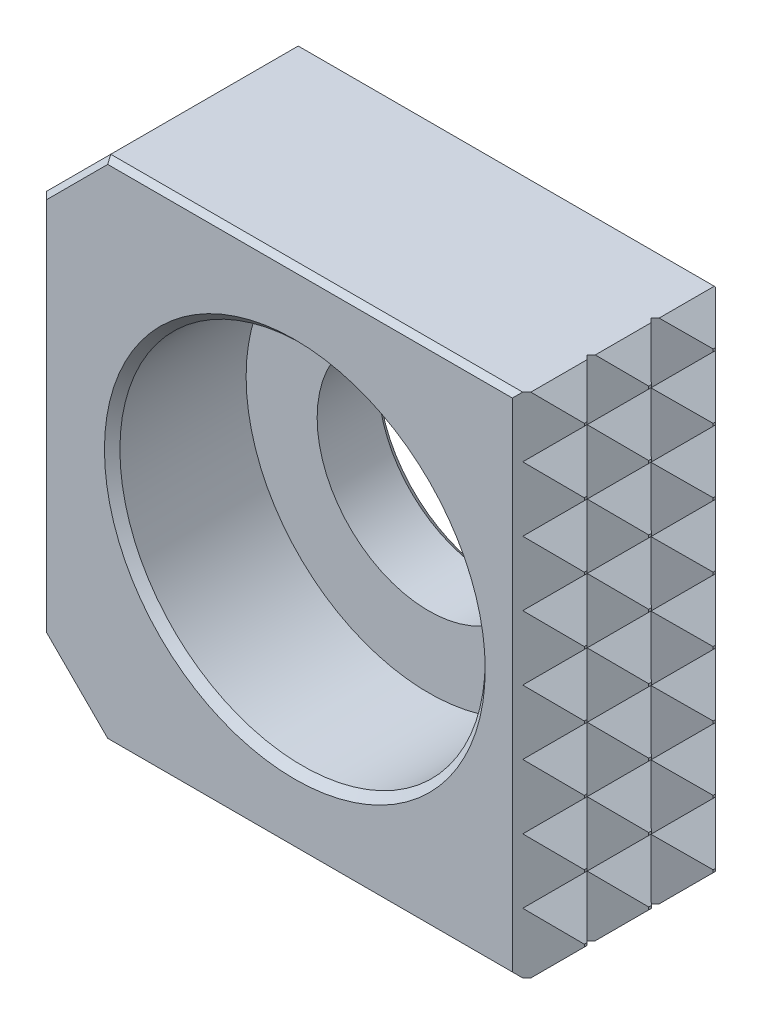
ISO-10303-21;
HEADER;
FILE_DESCRIPTION(('STEP AP214'),'2;1');
FILE_NAME('part.step','',(''),(''),'','','');
FILE_SCHEMA(('AUTOMOTIVE_DESIGN { 1 0 10303 214 1 1 1 1 }'));
ENDSEC;
DATA;
#1=APPLICATION_CONTEXT('core data for automotive mechanical design processes');
#2=APPLICATION_PROTOCOL_DEFINITION('international standard','automotive_design',2000,#1);
#3=PRODUCT_CONTEXT('',#1,'mechanical');
#4=PRODUCT('Part','Part','',(#3));
#5=PRODUCT_RELATED_PRODUCT_CATEGORY('part','',(#4));
#6=PRODUCT_DEFINITION_FORMATION('','',#4);
#7=PRODUCT_DEFINITION_CONTEXT('part definition',#1,'design');
#8=PRODUCT_DEFINITION('design','',#6,#7);
#9=PRODUCT_DEFINITION_SHAPE('','',#8);
#10=(LENGTH_UNIT() NAMED_UNIT(*) SI_UNIT(.MILLI.,.METRE.));
#11=(NAMED_UNIT(*) PLANE_ANGLE_UNIT() SI_UNIT($,.RADIAN.));
#12=(NAMED_UNIT(*) SI_UNIT($,.STERADIAN.) SOLID_ANGLE_UNIT());
#13=UNCERTAINTY_MEASURE_WITH_UNIT(LENGTH_MEASURE(1.E-05),#10,'distance_accuracy_value','');
#14=(GEOMETRIC_REPRESENTATION_CONTEXT(3) GLOBAL_UNCERTAINTY_ASSIGNED_CONTEXT((#13)) GLOBAL_UNIT_ASSIGNED_CONTEXT((#10,
#11,#12)) REPRESENTATION_CONTEXT('',''));
#15=CARTESIAN_POINT('',(0.,0.,0.));
#16=DIRECTION('',(0.,0.,1.));
#17=DIRECTION('',(1.,0.,0.));
#18=AXIS2_PLACEMENT_3D('',#15,#16,#17);
#19=CARTESIAN_POINT('',(0.,0.,3.2436));
#20=DIRECTION('',(0.,0.,1.));
#21=DIRECTION('',(-1.,0.,0.));
#22=AXIS2_PLACEMENT_3D('',#19,#20,#21);
#23=CYLINDRICAL_SURFACE('',#22,9.);
#24=CARTESIAN_POINT('',(0.,0.,9.619));
#25=DIRECTION('',(0.,0.,1.));
#26=DIRECTION('',(-1.,0.,0.));
#27=AXIS2_PLACEMENT_3D('',#24,#25,#26);
#28=CIRCLE('',#27,9.);
#29=CARTESIAN_POINT('',(-9.,0.,9.619));
#30=VERTEX_POINT('',#29);
#31=EDGE_CURVE('E1092',#30,#30,#28,.T.);
#32=ORIENTED_EDGE('',*,*,#31,.T.);
#33=EDGE_LOOP('',(#32));
#34=FACE_BOUND('',#33,.T.);
#35=CARTESIAN_POINT('',(0.,0.,3.4));
#36=DIRECTION('',(0.,0.,-1.));
#37=DIRECTION('',(-1.,0.,0.));
#38=AXIS2_PLACEMENT_3D('',#35,#36,#37);
#39=CIRCLE('',#38,9.);
#40=CARTESIAN_POINT('',(-9.,0.,3.4));
#41=VERTEX_POINT('',#40);
#42=EDGE_CURVE('E1152',#41,#41,#39,.F.);
#43=ORIENTED_EDGE('',*,*,#42,.F.);
#44=EDGE_LOOP('',(#43));
#45=FACE_BOUND('',#44,.T.);
#46=ADVANCED_FACE('F14',(#34,#45),#23,.F.);
#47=CARTESIAN_POINT('',(12.5,-12.5,10.));
#48=DIRECTION('',(-1.,0.,0.));
#49=DIRECTION('',(0.,-1.,0.));
#50=AXIS2_PLACEMENT_3D('',#47,#48,#49);
#51=PLANE('',#50);
#52=DIRECTION('',(0.,0.,-1.));
#53=VECTOR('',#52,1.);
#54=CARTESIAN_POINT('',(12.5,-1.52399952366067,10.));
#55=LINE('',#54,#53);
#56=CARTESIAN_POINT('',(12.5,-1.52399952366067,1.88900123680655));
#57=VERTEX_POINT('',#56);
#58=CARTESIAN_POINT('',(12.5,-1.52399952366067,1.76199397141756));
#59=VERTEX_POINT('',#58);
#60=EDGE_CURVE('E1059',#57,#59,#55,.T.);
#61=ORIENTED_EDGE('',*,*,#60,.F.);
#62=DIRECTION('',(0.,-1.,0.));
#63=VECTOR('',#62,1.);
#64=CARTESIAN_POINT('',(12.5,-12.5,1.88900123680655));
#65=LINE('',#64,#63);
#66=CARTESIAN_POINT('',(12.5,-1.65099952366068,1.88900123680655));
#67=VERTEX_POINT('',#66);
#68=EDGE_CURVE('E886',#57,#67,#65,.T.);
#69=ORIENTED_EDGE('',*,*,#68,.T.);
#70=DIRECTION('',(0.,0.,1.));
#71=VECTOR('',#70,1.);
#72=CARTESIAN_POINT('',(12.5,-1.65099952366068,10.));
#73=LINE('',#72,#71);
#74=CARTESIAN_POINT('',(12.5,-1.65099952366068,1.76199397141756));
#75=VERTEX_POINT('',#74);
#76=EDGE_CURVE('E1058',#75,#67,#73,.T.);
#77=ORIENTED_EDGE('',*,*,#76,.F.);
#78=DIRECTION('',(0.,1.,0.));
#79=VECTOR('',#78,1.);
#80=CARTESIAN_POINT('',(12.5,-12.5,1.76199397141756));
#81=LINE('',#80,#79);
#82=EDGE_CURVE('E582',#75,#59,#81,.T.);
#83=ORIENTED_EDGE('',*,*,#82,.T.);
#84=EDGE_LOOP('',(#61,#69,#77,#83));
#85=FACE_BOUND('',#84,.T.);
#86=ADVANCED_FACE('F1174',(#85),#51,.F.);
#87=CARTESIAN_POINT('',(12.5,-1.65099952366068,4.93717560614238));
#88=VERTEX_POINT('',#87);
#89=CARTESIAN_POINT('',(12.5,-1.65099952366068,5.06282439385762));
#90=VERTEX_POINT('',#89);
#91=EDGE_CURVE('E1057',#88,#90,#73,.T.);
#92=ORIENTED_EDGE('',*,*,#91,.F.);
#93=DIRECTION('',(0.,1.,0.));
#94=VECTOR('',#93,1.);
#95=CARTESIAN_POINT('',(12.5,-12.5,4.93717560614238));
#96=LINE('',#95,#94);
#97=CARTESIAN_POINT('',(12.5,-1.52399952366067,4.93717560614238));
#98=VERTEX_POINT('',#97);
#99=EDGE_CURVE('E821',#88,#98,#96,.T.);
#100=ORIENTED_EDGE('',*,*,#99,.T.);
#101=CARTESIAN_POINT('',(12.5,-1.52399952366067,5.06282439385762));
#102=VERTEX_POINT('',#101);
#103=EDGE_CURVE('E1062',#102,#98,#55,.T.);
#104=ORIENTED_EDGE('',*,*,#103,.F.);
#105=DIRECTION('',(0.,1.,0.));
#106=VECTOR('',#105,1.);
#107=CARTESIAN_POINT('',(12.5,-12.5,5.06282439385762));
#108=LINE('',#107,#106);
#109=EDGE_CURVE('E766',#90,#102,#108,.T.);
#110=ORIENTED_EDGE('',*,*,#109,.F.);
#111=EDGE_LOOP('',(#92,#100,#104,#110));
#112=FACE_BOUND('',#111,.T.);
#113=ADVANCED_FACE('F1180',(#112),#51,.F.);
#114=DIRECTION('',(0.,-1.,0.));
#115=VECTOR('',#114,1.);
#116=CARTESIAN_POINT('',(12.5,-12.5,8.11099876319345));
#117=LINE('',#116,#115);
#118=CARTESIAN_POINT('',(12.5,-1.52399952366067,8.11099876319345));
#119=VERTEX_POINT('',#118);
#120=CARTESIAN_POINT('',(12.5,-1.65099952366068,8.11099876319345));
#121=VERTEX_POINT('',#120);
#122=EDGE_CURVE('E712',#119,#121,#117,.T.);
#123=ORIENTED_EDGE('',*,*,#122,.F.);
#124=CARTESIAN_POINT('',(12.5,-1.52399952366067,8.23800602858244));
#125=VERTEX_POINT('',#124);
#126=EDGE_CURVE('E1063',#125,#119,#55,.T.);
#127=ORIENTED_EDGE('',*,*,#126,.F.);
#128=DIRECTION('',(0.,-1.,0.));
#129=VECTOR('',#128,1.);
#130=CARTESIAN_POINT('',(12.5,-12.5,8.23800602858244));
#131=LINE('',#130,#129);
#132=CARTESIAN_POINT('',(12.5,-1.65099952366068,8.23800602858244));
#133=VERTEX_POINT('',#132);
#134=EDGE_CURVE('E648',#125,#133,#131,.T.);
#135=ORIENTED_EDGE('',*,*,#134,.T.);
#136=EDGE_CURVE('E1054',#121,#133,#73,.T.);
#137=ORIENTED_EDGE('',*,*,#136,.F.);
#138=EDGE_LOOP('',(#123,#127,#135,#137));
#139=FACE_BOUND('',#138,.T.);
#140=ADVANCED_FACE('F1597',(#139),#51,.F.);
#141=DIRECTION('',(0.,0.,1.));
#142=VECTOR('',#141,1.);
#143=CARTESIAN_POINT('',(12.5,1.65099952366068,10.));
#144=LINE('',#143,#142);
#145=CARTESIAN_POINT('',(12.5,1.65099952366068,1.76199397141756));
#146=VERTEX_POINT('',#145);
#147=CARTESIAN_POINT('',(12.5,1.65099952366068,1.88900123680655));
#148=VERTEX_POINT('',#147);
#149=EDGE_CURVE('E993',#146,#148,#144,.T.);
#150=ORIENTED_EDGE('',*,*,#149,.T.);
#151=DIRECTION('',(0.,-1.,0.));
#152=VECTOR('',#151,1.);
#153=CARTESIAN_POINT('',(12.5,-12.5,1.88900123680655));
#154=LINE('',#153,#152);
#155=CARTESIAN_POINT('',(12.5,1.52399952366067,1.88900123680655));
#156=VERTEX_POINT('',#155);
#157=EDGE_CURVE('E883',#148,#156,#154,.T.);
#158=ORIENTED_EDGE('',*,*,#157,.T.);
#159=DIRECTION('',(0.,0.,-1.));
#160=VECTOR('',#159,1.);
#161=CARTESIAN_POINT('',(12.5,1.52399952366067,10.));
#162=LINE('',#161,#160);
#163=CARTESIAN_POINT('',(12.5,1.52399952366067,1.76199397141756));
#164=VERTEX_POINT('',#163);
#165=EDGE_CURVE('E1064',#156,#164,#162,.T.);
#166=ORIENTED_EDGE('',*,*,#165,.T.);
#167=DIRECTION('',(0.,1.,0.));
#168=VECTOR('',#167,1.);
#169=CARTESIAN_POINT('',(12.5,-12.5,1.76199397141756));
#170=LINE('',#169,#168);
#171=EDGE_CURVE('E579',#164,#146,#170,.T.);
#172=ORIENTED_EDGE('',*,*,#171,.T.);
#173=EDGE_LOOP('',(#150,#158,#166,#172));
#174=FACE_BOUND('',#173,.T.);
#175=ADVANCED_FACE('F1987',(#174),#51,.F.);
#176=CARTESIAN_POINT('',(12.5,1.52399952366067,5.06282439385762));
#177=VERTEX_POINT('',#176);
#178=CARTESIAN_POINT('',(12.5,1.52399952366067,4.93717560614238));
#179=VERTEX_POINT('',#178);
#180=EDGE_CURVE('E1067',#177,#179,#162,.T.);
#181=ORIENTED_EDGE('',*,*,#180,.T.);
#182=DIRECTION('',(0.,1.,0.));
#183=VECTOR('',#182,1.);
#184=CARTESIAN_POINT('',(12.5,-12.5,4.93717560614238));
#185=LINE('',#184,#183);
#186=CARTESIAN_POINT('',(12.5,1.65099952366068,4.93717560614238));
#187=VERTEX_POINT('',#186);
#188=EDGE_CURVE('E818',#179,#187,#185,.T.);
#189=ORIENTED_EDGE('',*,*,#188,.T.);
#190=CARTESIAN_POINT('',(12.5,1.65099952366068,5.06282439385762));
#191=VERTEX_POINT('',#190);
#192=EDGE_CURVE('E992',#187,#191,#144,.T.);
#193=ORIENTED_EDGE('',*,*,#192,.T.);
#194=DIRECTION('',(0.,1.,0.));
#195=VECTOR('',#194,1.);
#196=CARTESIAN_POINT('',(12.5,-12.5,5.06282439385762));
#197=LINE('',#196,#195);
#198=EDGE_CURVE('E764',#177,#191,#197,.T.);
#199=ORIENTED_EDGE('',*,*,#198,.F.);
#200=EDGE_LOOP('',(#181,#189,#193,#199));
#201=FACE_BOUND('',#200,.T.);
#202=ADVANCED_FACE('F1468',(#201),#51,.F.);
#203=DIRECTION('',(0.,-1.,0.));
#204=VECTOR('',#203,1.);
#205=CARTESIAN_POINT('',(12.5,-12.5,8.11099876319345));
#206=LINE('',#205,#204);
#207=CARTESIAN_POINT('',(12.5,1.65099952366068,8.11099876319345));
#208=VERTEX_POINT('',#207);
#209=CARTESIAN_POINT('',(12.5,1.52399952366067,8.11099876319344));
#210=VERTEX_POINT('',#209);
#211=EDGE_CURVE('E710',#208,#210,#206,.T.);
#212=ORIENTED_EDGE('',*,*,#211,.F.);
#213=CARTESIAN_POINT('',(12.5,1.65099952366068,8.23800602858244));
#214=VERTEX_POINT('',#213);
#215=EDGE_CURVE('E989',#208,#214,#144,.T.);
#216=ORIENTED_EDGE('',*,*,#215,.T.);
#217=DIRECTION('',(0.,-1.,0.));
#218=VECTOR('',#217,1.);
#219=CARTESIAN_POINT('',(12.5,-12.5,8.23800602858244));
#220=LINE('',#219,#218);
#221=CARTESIAN_POINT('',(12.5,1.52399952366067,8.23800602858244));
#222=VERTEX_POINT('',#221);
#223=EDGE_CURVE('E645',#214,#222,#220,.T.);
#224=ORIENTED_EDGE('',*,*,#223,.T.);
#225=EDGE_CURVE('E1068',#222,#210,#162,.T.);
#226=ORIENTED_EDGE('',*,*,#225,.T.);
#227=EDGE_LOOP('',(#212,#216,#224,#226));
#228=FACE_BOUND('',#227,.T.);
#229=ADVANCED_FACE('F1477',(#228),#51,.F.);
#230=DIRECTION('',(0.,0.,-1.));
#231=VECTOR('',#230,1.);
#232=CARTESIAN_POINT('',(12.5,-4.6989995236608,10.));
#233=LINE('',#232,#231);
#234=CARTESIAN_POINT('',(12.5,-4.6989995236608,1.88900123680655));
#235=VERTEX_POINT('',#234);
#236=CARTESIAN_POINT('',(12.5,-4.6989995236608,1.76199397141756));
#237=VERTEX_POINT('',#236);
#238=EDGE_CURVE('E1049',#235,#237,#233,.T.);
#239=ORIENTED_EDGE('',*,*,#238,.F.);
#240=DIRECTION('',(0.,-1.,0.));
#241=VECTOR('',#240,1.);
#242=CARTESIAN_POINT('',(12.5,-12.5,1.88900123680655));
#243=LINE('',#242,#241);
#244=CARTESIAN_POINT('',(12.5,-4.82599952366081,1.88900123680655));
#245=VERTEX_POINT('',#244);
#246=EDGE_CURVE('E897',#235,#245,#243,.T.);
#247=ORIENTED_EDGE('',*,*,#246,.T.);
#248=DIRECTION('',(0.,0.,1.));
#249=VECTOR('',#248,1.);
#250=CARTESIAN_POINT('',(12.5,-4.82599952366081,10.));
#251=LINE('',#250,#249);
#252=CARTESIAN_POINT('',(12.5,-4.82599952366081,1.76199397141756));
#253=VERTEX_POINT('',#252);
#254=EDGE_CURVE('E1048',#253,#245,#251,.T.);
#255=ORIENTED_EDGE('',*,*,#254,.F.);
#256=DIRECTION('',(0.,1.,0.));
#257=VECTOR('',#256,1.);
#258=CARTESIAN_POINT('',(12.5,-12.5,1.76199397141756));
#259=LINE('',#258,#257);
#260=EDGE_CURVE('E592',#253,#237,#259,.T.);
#261=ORIENTED_EDGE('',*,*,#260,.T.);
#262=EDGE_LOOP('',(#239,#247,#255,#261));
#263=FACE_BOUND('',#262,.T.);
#264=ADVANCED_FACE('F1546',(#263),#51,.F.);
#265=CARTESIAN_POINT('',(12.5,-4.82599952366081,4.93717560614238));
#266=VERTEX_POINT('',#265);
#267=CARTESIAN_POINT('',(12.5,-4.82599952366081,5.06282439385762));
#268=VERTEX_POINT('',#267);
#269=EDGE_CURVE('E1047',#266,#268,#251,.T.);
#270=ORIENTED_EDGE('',*,*,#269,.F.);
#271=DIRECTION('',(0.,1.,0.));
#272=VECTOR('',#271,1.);
#273=CARTESIAN_POINT('',(12.5,-12.5,4.93717560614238));
#274=LINE('',#273,#272);
#275=CARTESIAN_POINT('',(12.5,-4.6989995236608,4.93717560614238));
#276=VERTEX_POINT('',#275);
#277=EDGE_CURVE('E832',#266,#276,#274,.T.);
#278=ORIENTED_EDGE('',*,*,#277,.T.);
#279=CARTESIAN_POINT('',(12.5,-4.6989995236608,5.06282439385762));
#280=VERTEX_POINT('',#279);
#281=EDGE_CURVE('E1052',#280,#276,#233,.T.);
#282=ORIENTED_EDGE('',*,*,#281,.F.);
#283=DIRECTION('',(0.,1.,0.));
#284=VECTOR('',#283,1.);
#285=CARTESIAN_POINT('',(12.5,-12.5,5.06282439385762));
#286=LINE('',#285,#284);
#287=EDGE_CURVE('E777',#268,#280,#286,.T.);
#288=ORIENTED_EDGE('',*,*,#287,.F.);
#289=EDGE_LOOP('',(#270,#278,#282,#288));
#290=FACE_BOUND('',#289,.T.);
#291=ADVANCED_FACE('F1559',(#290),#51,.F.);
#292=DIRECTION('',(0.,-1.,0.));
#293=VECTOR('',#292,1.);
#294=CARTESIAN_POINT('',(12.5,-12.5,8.11099876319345));
#295=LINE('',#294,#293);
#296=CARTESIAN_POINT('',(12.5,-4.6989995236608,8.11099876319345));
#297=VERTEX_POINT('',#296);
#298=CARTESIAN_POINT('',(12.5,-4.82599952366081,8.11099876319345));
#299=VERTEX_POINT('',#298);
#300=EDGE_CURVE('E722',#297,#299,#295,.T.);
#301=ORIENTED_EDGE('',*,*,#300,.F.);
#302=CARTESIAN_POINT('',(12.5,-4.6989995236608,8.23800602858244));
#303=VERTEX_POINT('',#302);
#304=EDGE_CURVE('E1053',#303,#297,#233,.T.);
#305=ORIENTED_EDGE('',*,*,#304,.F.);
#306=DIRECTION('',(0.,-1.,0.));
#307=VECTOR('',#306,1.);
#308=CARTESIAN_POINT('',(12.5,-12.5,8.23800602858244));
#309=LINE('',#308,#307);
#310=CARTESIAN_POINT('',(12.5,-4.82599952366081,8.23800602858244));
#311=VERTEX_POINT('',#310);
#312=EDGE_CURVE('E658',#303,#311,#309,.T.);
#313=ORIENTED_EDGE('',*,*,#312,.T.);
#314=EDGE_CURVE('E1044',#299,#311,#251,.T.);
#315=ORIENTED_EDGE('',*,*,#314,.F.);
#316=EDGE_LOOP('',(#301,#305,#313,#315));
#317=FACE_BOUND('',#316,.T.);
#318=ADVANCED_FACE('F1588',(#317),#51,.F.);
#319=DIRECTION('',(0.,0.,-1.));
#320=VECTOR('',#319,1.);
#321=CARTESIAN_POINT('',(12.5,-7.87399952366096,10.));
#322=LINE('',#321,#320);
#323=CARTESIAN_POINT('',(12.5,-7.87399952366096,1.88900123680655));
#324=VERTEX_POINT('',#323);
#325=CARTESIAN_POINT('',(12.5,-7.87399952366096,1.76199397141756));
#326=VERTEX_POINT('',#325);
#327=EDGE_CURVE('E1039',#324,#326,#322,.T.);
#328=ORIENTED_EDGE('',*,*,#327,.F.);
#329=DIRECTION('',(0.,-1.,0.));
#330=VECTOR('',#329,1.);
#331=CARTESIAN_POINT('',(12.5,-12.5,1.88900123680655));
#332=LINE('',#331,#330);
#333=CARTESIAN_POINT('',(12.5,-8.00099952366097,1.88900123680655));
#334=VERTEX_POINT('',#333);
#335=EDGE_CURVE('E911',#324,#334,#332,.T.);
#336=ORIENTED_EDGE('',*,*,#335,.T.);
#337=DIRECTION('',(0.,0.,1.));
#338=VECTOR('',#337,1.);
#339=CARTESIAN_POINT('',(12.5,-8.00099952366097,10.));
#340=LINE('',#339,#338);
#341=CARTESIAN_POINT('',(12.5,-8.00099952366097,1.76199397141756));
#342=VERTEX_POINT('',#341);
#343=EDGE_CURVE('E1038',#342,#334,#340,.T.);
#344=ORIENTED_EDGE('',*,*,#343,.F.);
#345=DIRECTION('',(0.,1.,0.));
#346=VECTOR('',#345,1.);
#347=CARTESIAN_POINT('',(12.5,-12.5,1.76199397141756));
#348=LINE('',#347,#346);
#349=EDGE_CURVE('E605',#342,#326,#348,.T.);
#350=ORIENTED_EDGE('',*,*,#349,.T.);
#351=EDGE_LOOP('',(#328,#336,#344,#350));
#352=FACE_BOUND('',#351,.T.);
#353=ADVANCED_FACE('F2025',(#352),#51,.F.);
#354=CARTESIAN_POINT('',(12.5,-8.00099952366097,4.93717560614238));
#355=VERTEX_POINT('',#354);
#356=CARTESIAN_POINT('',(12.5,-8.00099952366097,5.06282439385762));
#357=VERTEX_POINT('',#356);
#358=EDGE_CURVE('E1037',#355,#357,#340,.T.);
#359=ORIENTED_EDGE('',*,*,#358,.F.);
#360=DIRECTION('',(0.,1.,0.));
#361=VECTOR('',#360,1.);
#362=CARTESIAN_POINT('',(12.5,-12.5,4.93717560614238));
#363=LINE('',#362,#361);
#364=CARTESIAN_POINT('',(12.5,-7.87399952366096,4.93717560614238));
#365=VERTEX_POINT('',#364);
#366=EDGE_CURVE('E846',#355,#365,#363,.T.);
#367=ORIENTED_EDGE('',*,*,#366,.T.);
#368=CARTESIAN_POINT('',(12.5,-7.87399952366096,5.06282439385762));
#369=VERTEX_POINT('',#368);
#370=EDGE_CURVE('E1042',#369,#365,#322,.T.);
#371=ORIENTED_EDGE('',*,*,#370,.F.);
#372=DIRECTION('',(0.,1.,0.));
#373=VECTOR('',#372,1.);
#374=CARTESIAN_POINT('',(12.5,-12.5,5.06282439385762));
#375=LINE('',#374,#373);
#376=EDGE_CURVE('E789',#357,#369,#375,.T.);
#377=ORIENTED_EDGE('',*,*,#376,.F.);
#378=EDGE_LOOP('',(#359,#367,#371,#377));
#379=FACE_BOUND('',#378,.T.);
#380=ADVANCED_FACE('F2032',(#379),#51,.F.);
#381=DIRECTION('',(0.,-1.,0.));
#382=VECTOR('',#381,1.);
#383=CARTESIAN_POINT('',(12.5,-12.5,8.11099876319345));
#384=LINE('',#383,#382);
#385=CARTESIAN_POINT('',(12.5,-7.87399952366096,8.11099876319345));
#386=VERTEX_POINT('',#385);
#387=CARTESIAN_POINT('',(12.5,-8.00099952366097,8.11099876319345));
#388=VERTEX_POINT('',#387);
#389=EDGE_CURVE('E735',#386,#388,#384,.T.);
#390=ORIENTED_EDGE('',*,*,#389,.F.);
#391=CARTESIAN_POINT('',(12.5,-7.87399952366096,8.23800602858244));
#392=VERTEX_POINT('',#391);
#393=EDGE_CURVE('E1043',#392,#386,#322,.T.);
#394=ORIENTED_EDGE('',*,*,#393,.F.);
#395=DIRECTION('',(0.,-1.,0.));
#396=VECTOR('',#395,1.);
#397=CARTESIAN_POINT('',(12.5,-12.5,8.23800602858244));
#398=LINE('',#397,#396);
#399=CARTESIAN_POINT('',(12.5,-8.00099952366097,8.23800602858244));
#400=VERTEX_POINT('',#399);
#401=EDGE_CURVE('E671',#392,#400,#398,.T.);
#402=ORIENTED_EDGE('',*,*,#401,.T.);
#403=EDGE_CURVE('E1034',#388,#400,#340,.T.);
#404=ORIENTED_EDGE('',*,*,#403,.F.);
#405=EDGE_LOOP('',(#390,#394,#402,#404));
#406=FACE_BOUND('',#405,.T.);
#407=ADVANCED_FACE('F1583',(#406),#51,.F.);
#408=DIRECTION('',(0.,0.,-1.));
#409=VECTOR('',#408,1.);
#410=CARTESIAN_POINT('',(12.5,-11.0489995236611,10.));
#411=LINE('',#410,#409);
#412=CARTESIAN_POINT('',(12.5,-11.0489995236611,1.88900123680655));
#413=VERTEX_POINT('',#412);
#414=CARTESIAN_POINT('',(12.5,-11.0489995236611,1.76199397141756));
#415=VERTEX_POINT('',#414);
#416=EDGE_CURVE('E1029',#413,#415,#411,.T.);
#417=ORIENTED_EDGE('',*,*,#416,.F.);
#418=DIRECTION('',(0.,-1.,0.));
#419=VECTOR('',#418,1.);
#420=CARTESIAN_POINT('',(12.5,-12.5,1.88900123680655));
#421=LINE('',#420,#419);
#422=CARTESIAN_POINT('',(12.5,-11.1759995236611,1.88900123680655));
#423=VERTEX_POINT('',#422);
#424=EDGE_CURVE('E922',#413,#423,#421,.T.);
#425=ORIENTED_EDGE('',*,*,#424,.T.);
#426=DIRECTION('',(0.,0.,1.));
#427=VECTOR('',#426,1.);
#428=CARTESIAN_POINT('',(12.5,-11.1759995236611,10.));
#429=LINE('',#428,#427);
#430=CARTESIAN_POINT('',(12.5,-11.1759995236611,1.76199397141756));
#431=VERTEX_POINT('',#430);
#432=EDGE_CURVE('E1028',#431,#423,#429,.T.);
#433=ORIENTED_EDGE('',*,*,#432,.F.);
#434=DIRECTION('',(0.,1.,0.));
#435=VECTOR('',#434,1.);
#436=CARTESIAN_POINT('',(12.5,-12.5,1.76199397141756));
#437=LINE('',#436,#435);
#438=EDGE_CURVE('E615',#431,#415,#437,.T.);
#439=ORIENTED_EDGE('',*,*,#438,.T.);
#440=EDGE_LOOP('',(#417,#425,#433,#439));
#441=FACE_BOUND('',#440,.T.);
#442=ADVANCED_FACE('F1308',(#441),#51,.F.);
#443=CARTESIAN_POINT('',(12.5,-11.1759995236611,4.93717560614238));
#444=VERTEX_POINT('',#443);
#445=CARTESIAN_POINT('',(12.5,-11.1759995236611,5.06282439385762));
#446=VERTEX_POINT('',#445);
#447=EDGE_CURVE('E1027',#444,#446,#429,.T.);
#448=ORIENTED_EDGE('',*,*,#447,.F.);
#449=DIRECTION('',(0.,1.,0.));
#450=VECTOR('',#449,1.);
#451=CARTESIAN_POINT('',(12.5,-12.5,4.93717560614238));
#452=LINE('',#451,#450);
#453=CARTESIAN_POINT('',(12.5,-11.0489995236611,4.93717560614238));
#454=VERTEX_POINT('',#453);
#455=EDGE_CURVE('E857',#444,#454,#452,.T.);
#456=ORIENTED_EDGE('',*,*,#455,.T.);
#457=CARTESIAN_POINT('',(12.5,-11.0489995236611,5.06282439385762));
#458=VERTEX_POINT('',#457);
#459=EDGE_CURVE('E1032',#458,#454,#411,.T.);
#460=ORIENTED_EDGE('',*,*,#459,.F.);
#461=DIRECTION('',(0.,1.,0.));
#462=VECTOR('',#461,1.);
#463=CARTESIAN_POINT('',(12.5,-12.5,5.06282439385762));
#464=LINE('',#463,#462);
#465=EDGE_CURVE('E798',#446,#458,#464,.T.);
#466=ORIENTED_EDGE('',*,*,#465,.F.);
#467=EDGE_LOOP('',(#448,#456,#460,#466));
#468=FACE_BOUND('',#467,.T.);
#469=ADVANCED_FACE('F1263',(#468),#51,.F.);
#470=DIRECTION('',(0.,-1.,0.));
#471=VECTOR('',#470,1.);
#472=CARTESIAN_POINT('',(12.5,-12.5,8.11099876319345));
#473=LINE('',#472,#471);
#474=CARTESIAN_POINT('',(12.5,-11.0489995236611,8.11099876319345));
#475=VERTEX_POINT('',#474);
#476=CARTESIAN_POINT('',(12.5,-11.1759995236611,8.11099876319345));
#477=VERTEX_POINT('',#476);
#478=EDGE_CURVE('E745',#475,#477,#473,.T.);
#479=ORIENTED_EDGE('',*,*,#478,.F.);
#480=CARTESIAN_POINT('',(12.5,-11.0489995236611,8.23800602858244));
#481=VERTEX_POINT('',#480);
#482=EDGE_CURVE('E1033',#481,#475,#411,.T.);
#483=ORIENTED_EDGE('',*,*,#482,.F.);
#484=DIRECTION('',(0.,-1.,0.));
#485=VECTOR('',#484,1.);
#486=CARTESIAN_POINT('',(12.5,-12.5,8.23800602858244));
#487=LINE('',#486,#485);
#488=CARTESIAN_POINT('',(12.5,-11.1759995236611,8.23800602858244));
#489=VERTEX_POINT('',#488);
#490=EDGE_CURVE('E681',#481,#489,#487,.T.);
#491=ORIENTED_EDGE('',*,*,#490,.T.);
#492=EDGE_CURVE('E1024',#477,#489,#429,.T.);
#493=ORIENTED_EDGE('',*,*,#492,.F.);
#494=EDGE_LOOP('',(#479,#483,#491,#493));
#495=FACE_BOUND('',#494,.T.);
#496=ADVANCED_FACE('F1275',(#495),#51,.F.);
#497=DIRECTION('',(0.,0.,1.));
#498=VECTOR('',#497,1.);
#499=CARTESIAN_POINT('',(12.5,11.1759995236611,10.));
#500=LINE('',#499,#498);
#501=CARTESIAN_POINT('',(12.5,11.1759995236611,1.76199397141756));
#502=VERTEX_POINT('',#501);
#503=CARTESIAN_POINT('',(12.5,11.1759995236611,1.88900123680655));
#504=VERTEX_POINT('',#503);
#505=EDGE_CURVE('E1023',#502,#504,#500,.T.);
#506=ORIENTED_EDGE('',*,*,#505,.T.);
#507=DIRECTION('',(0.,-1.,0.));
#508=VECTOR('',#507,1.);
#509=CARTESIAN_POINT('',(12.5,-12.5,1.88900123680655));
#510=LINE('',#509,#508);
#511=CARTESIAN_POINT('',(12.5,11.0489995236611,1.88900123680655));
#512=VERTEX_POINT('',#511);
#513=EDGE_CURVE('E939',#504,#512,#510,.T.);
#514=ORIENTED_EDGE('',*,*,#513,.T.);
#515=DIRECTION('',(0.,0.,-1.));
#516=VECTOR('',#515,1.);
#517=CARTESIAN_POINT('',(12.5,11.0489995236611,10.));
#518=LINE('',#517,#516);
#519=CARTESIAN_POINT('',(12.5,11.0489995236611,1.76199397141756));
#520=VERTEX_POINT('',#519);
#521=EDGE_CURVE('E1014',#512,#520,#518,.T.);
#522=ORIENTED_EDGE('',*,*,#521,.T.);
#523=DIRECTION('',(0.,1.,0.));
#524=VECTOR('',#523,1.);
#525=CARTESIAN_POINT('',(12.5,-12.5,1.76199397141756));
#526=LINE('',#525,#524);
#527=EDGE_CURVE('E633',#520,#502,#526,.T.);
#528=ORIENTED_EDGE('',*,*,#527,.T.);
#529=EDGE_LOOP('',(#506,#514,#522,#528));
#530=FACE_BOUND('',#529,.T.);
#531=ADVANCED_FACE('F1341',(#530),#51,.F.);
#532=CARTESIAN_POINT('',(12.5,11.0489995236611,5.06282439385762));
#533=VERTEX_POINT('',#532);
#534=CARTESIAN_POINT('',(12.5,11.0489995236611,4.93717560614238));
#535=VERTEX_POINT('',#534);
#536=EDGE_CURVE('E1017',#533,#535,#518,.T.);
#537=ORIENTED_EDGE('',*,*,#536,.T.);
#538=DIRECTION('',(0.,1.,0.));
#539=VECTOR('',#538,1.);
#540=CARTESIAN_POINT('',(12.5,-12.5,4.93717560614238));
#541=LINE('',#540,#539);
#542=CARTESIAN_POINT('',(12.5,11.1759995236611,4.93717560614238));
#543=VERTEX_POINT('',#542);
#544=EDGE_CURVE('E874',#535,#543,#541,.T.);
#545=ORIENTED_EDGE('',*,*,#544,.T.);
#546=CARTESIAN_POINT('',(12.5,11.1759995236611,5.06282439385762));
#547=VERTEX_POINT('',#546);
#548=EDGE_CURVE('E1022',#543,#547,#500,.T.);
#549=ORIENTED_EDGE('',*,*,#548,.T.);
#550=DIRECTION('',(0.,1.,0.));
#551=VECTOR('',#550,1.);
#552=CARTESIAN_POINT('',(12.5,-12.5,5.06282439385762));
#553=LINE('',#552,#551);
#554=EDGE_CURVE('E811',#533,#547,#553,.T.);
#555=ORIENTED_EDGE('',*,*,#554,.F.);
#556=EDGE_LOOP('',(#537,#545,#549,#555));
#557=FACE_BOUND('',#556,.T.);
#558=ADVANCED_FACE('F1348',(#557),#51,.F.);
#559=DIRECTION('',(0.,-1.,0.));
#560=VECTOR('',#559,1.);
#561=CARTESIAN_POINT('',(12.5,-12.5,8.11099876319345));
#562=LINE('',#561,#560);
#563=CARTESIAN_POINT('',(12.5,11.1759995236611,8.11099876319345));
#564=VERTEX_POINT('',#563);
#565=CARTESIAN_POINT('',(12.5,11.0489995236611,8.11099876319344));
#566=VERTEX_POINT('',#565);
#567=EDGE_CURVE('E758',#564,#566,#562,.T.);
#568=ORIENTED_EDGE('',*,*,#567,.F.);
#569=CARTESIAN_POINT('',(12.5,11.1759995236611,8.23800602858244));
#570=VERTEX_POINT('',#569);
#571=EDGE_CURVE('E1019',#564,#570,#500,.T.);
#572=ORIENTED_EDGE('',*,*,#571,.T.);
#573=DIRECTION('',(0.,-1.,0.));
#574=VECTOR('',#573,1.);
#575=CARTESIAN_POINT('',(12.5,-12.5,8.23800602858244));
#576=LINE('',#575,#574);
#577=CARTESIAN_POINT('',(12.5,11.0489995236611,8.23800602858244));
#578=VERTEX_POINT('',#577);
#579=EDGE_CURVE('E698',#570,#578,#576,.T.);
#580=ORIENTED_EDGE('',*,*,#579,.T.);
#581=EDGE_CURVE('E1018',#578,#566,#518,.T.);
#582=ORIENTED_EDGE('',*,*,#581,.T.);
#583=EDGE_LOOP('',(#568,#572,#580,#582));
#584=FACE_BOUND('',#583,.T.);
#585=ADVANCED_FACE('F1370',(#584),#51,.F.);
#586=DIRECTION('',(0.,0.,1.));
#587=VECTOR('',#586,1.);
#588=CARTESIAN_POINT('',(12.5,8.00099952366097,10.));
#589=LINE('',#588,#587);
#590=CARTESIAN_POINT('',(12.5,8.00099952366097,1.76199397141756));
#591=VERTEX_POINT('',#590);
#592=CARTESIAN_POINT('',(12.5,8.00099952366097,1.88900123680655));
#593=VERTEX_POINT('',#592);
#594=EDGE_CURVE('E1013',#591,#593,#589,.T.);
#595=ORIENTED_EDGE('',*,*,#594,.T.);
#596=DIRECTION('',(0.,-1.,0.));
#597=VECTOR('',#596,1.);
#598=CARTESIAN_POINT('',(12.5,-12.5,1.88900123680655));
#599=LINE('',#598,#597);
#600=CARTESIAN_POINT('',(12.5,7.87399952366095,1.88900123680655));
#601=VERTEX_POINT('',#600);
#602=EDGE_CURVE('E930',#593,#601,#599,.T.);
#603=ORIENTED_EDGE('',*,*,#602,.T.);
#604=DIRECTION('',(0.,0.,-1.));
#605=VECTOR('',#604,1.);
#606=CARTESIAN_POINT('',(12.5,7.87399952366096,10.));
#607=LINE('',#606,#605);
#608=CARTESIAN_POINT('',(12.5,7.87399952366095,1.76199397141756));
#609=VERTEX_POINT('',#608);
#610=EDGE_CURVE('E1004',#601,#609,#607,.T.);
#611=ORIENTED_EDGE('',*,*,#610,.T.);
#612=DIRECTION('',(0.,1.,0.));
#613=VECTOR('',#612,1.);
#614=CARTESIAN_POINT('',(12.5,-12.5,1.76199397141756));
#615=LINE('',#614,#613);
#616=EDGE_CURVE('E624',#609,#591,#615,.T.);
#617=ORIENTED_EDGE('',*,*,#616,.T.);
#618=EDGE_LOOP('',(#595,#603,#611,#617));
#619=FACE_BOUND('',#618,.T.);
#620=ADVANCED_FACE('F2083',(#619),#51,.F.);
#621=CARTESIAN_POINT('',(12.5,7.87399952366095,5.06282439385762));
#622=VERTEX_POINT('',#621);
#623=CARTESIAN_POINT('',(12.5,7.87399952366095,4.93717560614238));
#624=VERTEX_POINT('',#623);
#625=EDGE_CURVE('E1007',#622,#624,#607,.T.);
#626=ORIENTED_EDGE('',*,*,#625,.T.);
#627=DIRECTION('',(0.,1.,0.));
#628=VECTOR('',#627,1.);
#629=CARTESIAN_POINT('',(12.5,-12.5,4.93717560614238));
#630=LINE('',#629,#628);
#631=CARTESIAN_POINT('',(12.5,8.00099952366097,4.93717560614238));
#632=VERTEX_POINT('',#631);
#633=EDGE_CURVE('E865',#624,#632,#630,.T.);
#634=ORIENTED_EDGE('',*,*,#633,.T.);
#635=CARTESIAN_POINT('',(12.5,8.00099952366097,5.06282439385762));
#636=VERTEX_POINT('',#635);
#637=EDGE_CURVE('E1012',#632,#636,#589,.T.);
#638=ORIENTED_EDGE('',*,*,#637,.T.);
#639=DIRECTION('',(0.,1.,0.));
#640=VECTOR('',#639,1.);
#641=CARTESIAN_POINT('',(12.5,-12.5,5.06282439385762));
#642=LINE('',#641,#640);
#643=EDGE_CURVE('E804',#622,#636,#642,.T.);
#644=ORIENTED_EDGE('',*,*,#643,.F.);
#645=EDGE_LOOP('',(#626,#634,#638,#644));
#646=FACE_BOUND('',#645,.T.);
#647=ADVANCED_FACE('F1397',(#646),#51,.F.);
#648=DIRECTION('',(0.,-1.,0.));
#649=VECTOR('',#648,1.);
#650=CARTESIAN_POINT('',(12.5,-12.5,8.11099876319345));
#651=LINE('',#650,#649);
#652=CARTESIAN_POINT('',(12.5,8.00099952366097,8.11099876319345));
#653=VERTEX_POINT('',#652);
#654=CARTESIAN_POINT('',(12.5,7.87399952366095,8.11099876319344));
#655=VERTEX_POINT('',#654);
#656=EDGE_CURVE('E751',#653,#655,#651,.T.);
#657=ORIENTED_EDGE('',*,*,#656,.F.);
#658=CARTESIAN_POINT('',(12.5,8.00099952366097,8.23800602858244));
#659=VERTEX_POINT('',#658);
#660=EDGE_CURVE('E1009',#653,#659,#589,.T.);
#661=ORIENTED_EDGE('',*,*,#660,.T.);
#662=DIRECTION('',(0.,-1.,0.));
#663=VECTOR('',#662,1.);
#664=CARTESIAN_POINT('',(12.5,-12.5,8.23800602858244));
#665=LINE('',#664,#663);
#666=CARTESIAN_POINT('',(12.5,7.87399952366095,8.23800602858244));
#667=VERTEX_POINT('',#666);
#668=EDGE_CURVE('E689',#659,#667,#665,.T.);
#669=ORIENTED_EDGE('',*,*,#668,.T.);
#670=EDGE_CURVE('E1008',#667,#655,#607,.T.);
#671=ORIENTED_EDGE('',*,*,#670,.T.);
#672=EDGE_LOOP('',(#657,#661,#669,#671));
#673=FACE_BOUND('',#672,.T.);
#674=ADVANCED_FACE('F1406',(#673),#51,.F.);
#675=DIRECTION('',(0.,0.,1.));
#676=VECTOR('',#675,1.);
#677=CARTESIAN_POINT('',(12.5,4.82599952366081,10.));
#678=LINE('',#677,#676);
#679=CARTESIAN_POINT('',(12.5,4.82599952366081,1.76199397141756));
#680=VERTEX_POINT('',#679);
#681=CARTESIAN_POINT('',(12.5,4.82599952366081,1.88900123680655));
#682=VERTEX_POINT('',#681);
#683=EDGE_CURVE('E1003',#680,#682,#678,.T.);
#684=ORIENTED_EDGE('',*,*,#683,.T.);
#685=DIRECTION('',(0.,-1.,0.));
#686=VECTOR('',#685,1.);
#687=CARTESIAN_POINT('',(12.5,-12.5,1.88900123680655));
#688=LINE('',#687,#686);
#689=CARTESIAN_POINT('',(12.5,4.6989995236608,1.88900123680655));
#690=VERTEX_POINT('',#689);
#691=EDGE_CURVE('E908',#682,#690,#688,.T.);
#692=ORIENTED_EDGE('',*,*,#691,.T.);
#693=DIRECTION('',(0.,0.,-1.));
#694=VECTOR('',#693,1.);
#695=CARTESIAN_POINT('',(12.5,4.6989995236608,10.));
#696=LINE('',#695,#694);
#697=CARTESIAN_POINT('',(12.5,4.6989995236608,1.76199397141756));
#698=VERTEX_POINT('',#697);
#699=EDGE_CURVE('E994',#690,#698,#696,.T.);
#700=ORIENTED_EDGE('',*,*,#699,.T.);
#701=DIRECTION('',(0.,1.,0.));
#702=VECTOR('',#701,1.);
#703=CARTESIAN_POINT('',(12.5,-12.5,1.76199397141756));
#704=LINE('',#703,#702);
#705=EDGE_CURVE('E602',#698,#680,#704,.T.);
#706=ORIENTED_EDGE('',*,*,#705,.T.);
#707=EDGE_LOOP('',(#684,#692,#700,#706));
#708=FACE_BOUND('',#707,.T.);
#709=ADVANCED_FACE('F2103',(#708),#51,.F.);
#710=CARTESIAN_POINT('',(12.5,4.6989995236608,5.06282439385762));
#711=VERTEX_POINT('',#710);
#712=CARTESIAN_POINT('',(12.5,4.6989995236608,4.93717560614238));
#713=VERTEX_POINT('',#712);
#714=EDGE_CURVE('E997',#711,#713,#696,.T.);
#715=ORIENTED_EDGE('',*,*,#714,.T.);
#716=DIRECTION('',(0.,1.,0.));
#717=VECTOR('',#716,1.);
#718=CARTESIAN_POINT('',(12.5,-12.5,4.93717560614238));
#719=LINE('',#718,#717);
#720=CARTESIAN_POINT('',(12.5,4.82599952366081,4.93717560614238));
#721=VERTEX_POINT('',#720);
#722=EDGE_CURVE('E843',#713,#721,#719,.T.);
#723=ORIENTED_EDGE('',*,*,#722,.T.);
#724=CARTESIAN_POINT('',(12.5,4.82599952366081,5.06282439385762));
#725=VERTEX_POINT('',#724);
#726=EDGE_CURVE('E1002',#721,#725,#678,.T.);
#727=ORIENTED_EDGE('',*,*,#726,.T.);
#728=DIRECTION('',(0.,1.,0.));
#729=VECTOR('',#728,1.);
#730=CARTESIAN_POINT('',(12.5,-12.5,5.06282439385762));
#731=LINE('',#730,#729);
#732=EDGE_CURVE('E787',#711,#725,#731,.T.);
#733=ORIENTED_EDGE('',*,*,#732,.F.);
#734=EDGE_LOOP('',(#715,#723,#727,#733));
#735=FACE_BOUND('',#734,.T.);
#736=ADVANCED_FACE('F2457',(#735),#51,.F.);
#737=DIRECTION('',(0.,-1.,0.));
#738=VECTOR('',#737,1.);
#739=CARTESIAN_POINT('',(12.5,-12.5,8.11099876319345));
#740=LINE('',#739,#738);
#741=CARTESIAN_POINT('',(12.5,4.82599952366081,8.11099876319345));
#742=VERTEX_POINT('',#741);
#743=CARTESIAN_POINT('',(12.5,4.6989995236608,8.11099876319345));
#744=VERTEX_POINT('',#743);
#745=EDGE_CURVE('E733',#742,#744,#740,.T.);
#746=ORIENTED_EDGE('',*,*,#745,.F.);
#747=CARTESIAN_POINT('',(12.5,4.82599952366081,8.23800602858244));
#748=VERTEX_POINT('',#747);
#749=EDGE_CURVE('E999',#742,#748,#678,.T.);
#750=ORIENTED_EDGE('',*,*,#749,.T.);
#751=DIRECTION('',(0.,-1.,0.));
#752=VECTOR('',#751,1.);
#753=CARTESIAN_POINT('',(12.5,-12.5,8.23800602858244));
#754=LINE('',#753,#752);
#755=CARTESIAN_POINT('',(12.5,4.6989995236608,8.23800602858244));
#756=VERTEX_POINT('',#755);
#757=EDGE_CURVE('E668',#748,#756,#754,.T.);
#758=ORIENTED_EDGE('',*,*,#757,.T.);
#759=EDGE_CURVE('E998',#756,#744,#696,.T.);
#760=ORIENTED_EDGE('',*,*,#759,.T.);
#761=EDGE_LOOP('',(#746,#750,#758,#760));
#762=FACE_BOUND('',#761,.T.);
#763=ADVANCED_FACE('F1182',(#762),#51,.F.);
#764=CARTESIAN_POINT('',(12.5,-12.5,10.));
#765=DIRECTION('',(0.,-1.,0.));
#766=DIRECTION('',(1.,0.,0.));
#767=AXIS2_PLACEMENT_3D('',#764,#765,#766);
#768=PLANE('',#767);
#769=DIRECTION('',(0.710878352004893,0.,-0.703314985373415));
#770=VECTOR('',#769,1.);
#771=CARTESIAN_POINT('',(9.33228776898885,-12.5,11.3720154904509));
#772=LINE('',#771,#770);
#773=CARTESIAN_POINT('',(10.9757892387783,-12.5,9.746));
#774=VERTEX_POINT('',#773);
#775=CARTESIAN_POINT('',(11.1759999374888,-12.5,9.54791943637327));
#776=VERTEX_POINT('',#775);
#777=EDGE_CURVE('E546',#774,#776,#772,.T.);
#778=ORIENTED_EDGE('',*,*,#777,.F.);
#779=DIRECTION('',(-1.,0.,0.));
#780=VECTOR('',#779,1.);
#781=CARTESIAN_POINT('',(12.5,-12.5,9.746));
#782=LINE('',#781,#780);
#783=CARTESIAN_POINT('',(-9.325,-12.5,9.746));
#784=VERTEX_POINT('',#783);
#785=EDGE_CURVE('E1129',#774,#784,#782,.T.);
#786=ORIENTED_EDGE('',*,*,#785,.T.);
#787=DIRECTION('',(0.,0.,-1.));
#788=VECTOR('',#787,1.);
#789=CARTESIAN_POINT('',(-9.325,-12.5,0.));
#790=LINE('',#789,#788);
#791=CARTESIAN_POINT('',(-9.325,-12.5,0.508));
#792=VERTEX_POINT('',#791);
#793=EDGE_CURVE('E1084',#784,#792,#790,.T.);
#794=ORIENTED_EDGE('',*,*,#793,.T.);
#795=DIRECTION('',(1.,0.,0.));
#796=VECTOR('',#795,1.);
#797=CARTESIAN_POINT('',(10.7190577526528,-12.5,0.508));
#798=LINE('',#797,#796);
#799=CARTESIAN_POINT('',(11.1759999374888,-12.5,0.508));
#800=VERTEX_POINT('',#799);
#801=EDGE_CURVE('E1109',#792,#800,#798,.T.);
#802=ORIENTED_EDGE('',*,*,#801,.T.);
#803=DIRECTION('',(0.,0.,-1.));
#804=VECTOR('',#803,1.);
#805=CARTESIAN_POINT('',(11.1759999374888,-12.5,10.));
#806=LINE('',#805,#804);
#807=CARTESIAN_POINT('',(11.1759999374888,-12.5,3.22723944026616));
#808=VERTEX_POINT('',#807);
#809=EDGE_CURVE('E967',#808,#800,#806,.T.);
#810=ORIENTED_EDGE('',*,*,#809,.F.);
#811=DIRECTION('',(0.703314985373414,0.,-0.710878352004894));
#812=VECTOR('',#811,1.);
#813=CARTESIAN_POINT('',(10.976,-12.5,3.42939015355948));
#814=LINE('',#813,#812);
#815=CARTESIAN_POINT('',(10.976,-12.5,3.42939015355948));
#816=VERTEX_POINT('',#815);
#817=EDGE_CURVE('E1246',#816,#808,#814,.T.);
#818=ORIENTED_EDGE('',*,*,#817,.F.);
#819=DIRECTION('',(-0.710878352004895,0.,-0.703314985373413));
#820=VECTOR('',#819,1.);
#821=CARTESIAN_POINT('',(12.5635,-12.5,5.));
#822=LINE('',#821,#820);
#823=CARTESIAN_POINT('',(11.1759999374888,-12.5,3.62726219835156));
#824=VERTEX_POINT('',#823);
#825=EDGE_CURVE('E554',#824,#816,#822,.T.);
#826=ORIENTED_EDGE('',*,*,#825,.F.);
#827=CARTESIAN_POINT('',(11.1759999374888,-12.5,6.37273780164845));
#828=VERTEX_POINT('',#827);
#829=EDGE_CURVE('E553',#828,#824,#806,.T.);
#830=ORIENTED_EDGE('',*,*,#829,.F.);
#831=DIRECTION('',(-0.710878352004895,0.,0.703314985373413));
#832=VECTOR('',#831,1.);
#833=CARTESIAN_POINT('',(12.5635,-12.5,5.));
#834=LINE('',#833,#832);
#835=CARTESIAN_POINT('',(10.976,-12.5,6.57060984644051));
#836=VERTEX_POINT('',#835);
#837=EDGE_CURVE('E528',#828,#836,#834,.T.);
#838=ORIENTED_EDGE('',*,*,#837,.T.);
#839=DIRECTION('',(0.703314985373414,0.,0.710878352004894));
#840=VECTOR('',#839,1.);
#841=CARTESIAN_POINT('',(10.976,-12.5,6.57060984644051));
#842=LINE('',#841,#840);
#843=CARTESIAN_POINT('',(11.1759999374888,-12.5,6.77276055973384));
#844=VERTEX_POINT('',#843);
#845=EDGE_CURVE('E539',#836,#844,#842,.T.);
#846=ORIENTED_EDGE('',*,*,#845,.T.);
#847=EDGE_CURVE('E966',#776,#844,#806,.T.);
#848=ORIENTED_EDGE('',*,*,#847,.F.);
#849=EDGE_LOOP('',(#778,#786,#794,#802,#810,#818,#826,#830,#838,#846,#848));
#850=FACE_BOUND('',#849,.T.);
#851=ADVANCED_FACE('F550',(#850),#768,.T.);
#852=CARTESIAN_POINT('',(-12.5,12.5,10.));
#853=DIRECTION('',(0.,1.,0.));
#854=DIRECTION('',(-1.,0.,0.));
#855=AXIS2_PLACEMENT_3D('',#852,#853,#854);
#856=PLANE('',#855);
#857=DIRECTION('',(0.,0.,1.));
#858=VECTOR('',#857,1.);
#859=CARTESIAN_POINT('',(-9.325,12.5,10.));
#860=LINE('',#859,#858);
#861=CARTESIAN_POINT('',(-9.325,12.5,0.508));
#862=VERTEX_POINT('',#861);
#863=CARTESIAN_POINT('',(-9.325,12.5,9.746));
#864=VERTEX_POINT('',#863);
#865=EDGE_CURVE('E1090',#862,#864,#860,.T.);
#866=ORIENTED_EDGE('',*,*,#865,.T.);
#867=DIRECTION('',(1.,0.,0.));
#868=VECTOR('',#867,1.);
#869=CARTESIAN_POINT('',(-12.5,12.5,9.746));
#870=LINE('',#869,#868);
#871=CARTESIAN_POINT('',(10.9757892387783,12.5,9.746));
#872=VERTEX_POINT('',#871);
#873=EDGE_CURVE('E1150',#864,#872,#870,.T.);
#874=ORIENTED_EDGE('',*,*,#873,.T.);
#875=DIRECTION('',(0.710878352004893,0.,-0.703314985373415));
#876=VECTOR('',#875,1.);
#877=CARTESIAN_POINT('',(9.33228776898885,12.5,11.3720154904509));
#878=LINE('',#877,#876);
#879=CARTESIAN_POINT('',(11.1759999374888,12.5,9.54791943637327));
#880=VERTEX_POINT('',#879);
#881=EDGE_CURVE('E563',#872,#880,#878,.T.);
#882=ORIENTED_EDGE('',*,*,#881,.T.);
#883=DIRECTION('',(0.,0.,-1.));
#884=VECTOR('',#883,1.);
#885=CARTESIAN_POINT('',(11.1759999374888,12.5,10.));
#886=LINE('',#885,#884);
#887=CARTESIAN_POINT('',(11.1759999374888,12.5,6.77276055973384));
#888=VERTEX_POINT('',#887);
#889=EDGE_CURVE('E970',#880,#888,#886,.T.);
#890=ORIENTED_EDGE('',*,*,#889,.T.);
#891=DIRECTION('',(0.703314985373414,0.,0.710878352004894));
#892=VECTOR('',#891,1.);
#893=CARTESIAN_POINT('',(10.976,12.5,6.57060984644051));
#894=LINE('',#893,#892);
#895=CARTESIAN_POINT('',(10.976,12.5,6.57060984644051));
#896=VERTEX_POINT('',#895);
#897=EDGE_CURVE('E565',#896,#888,#894,.T.);
#898=ORIENTED_EDGE('',*,*,#897,.F.);
#899=DIRECTION('',(-0.710878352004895,0.,0.703314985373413));
#900=VECTOR('',#899,1.);
#901=CARTESIAN_POINT('',(12.5635,12.5,5.));
#902=LINE('',#901,#900);
#903=CARTESIAN_POINT('',(11.1759999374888,12.5,6.37273780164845));
#904=VERTEX_POINT('',#903);
#905=EDGE_CURVE('E567',#904,#896,#902,.T.);
#906=ORIENTED_EDGE('',*,*,#905,.F.);
#907=CARTESIAN_POINT('',(11.1759999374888,12.5,3.62726219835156));
#908=VERTEX_POINT('',#907);
#909=EDGE_CURVE('E974',#904,#908,#886,.T.);
#910=ORIENTED_EDGE('',*,*,#909,.T.);
#911=DIRECTION('',(-0.710878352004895,0.,-0.703314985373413));
#912=VECTOR('',#911,1.);
#913=CARTESIAN_POINT('',(12.5635,12.5,5.));
#914=LINE('',#913,#912);
#915=CARTESIAN_POINT('',(10.976,12.5,3.42939015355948));
#916=VERTEX_POINT('',#915);
#917=EDGE_CURVE('E535',#908,#916,#914,.T.);
#918=ORIENTED_EDGE('',*,*,#917,.T.);
#919=DIRECTION('',(0.703314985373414,0.,-0.710878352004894));
#920=VECTOR('',#919,1.);
#921=CARTESIAN_POINT('',(10.976,12.5,3.42939015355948));
#922=LINE('',#921,#920);
#923=CARTESIAN_POINT('',(11.1759999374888,12.5,3.22723944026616));
#924=VERTEX_POINT('',#923);
#925=EDGE_CURVE('E557',#916,#924,#922,.T.);
#926=ORIENTED_EDGE('',*,*,#925,.T.);
#927=CARTESIAN_POINT('',(11.1759999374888,12.5,0.508));
#928=VERTEX_POINT('',#927);
#929=EDGE_CURVE('E971',#924,#928,#886,.T.);
#930=ORIENTED_EDGE('',*,*,#929,.T.);
#931=DIRECTION('',(-1.,0.,0.));
#932=VECTOR('',#931,1.);
#933=CARTESIAN_POINT('',(-9.325,12.5,0.508));
#934=LINE('',#933,#932);
#935=EDGE_CURVE('E1127',#928,#862,#934,.T.);
#936=ORIENTED_EDGE('',*,*,#935,.T.);
#937=EDGE_LOOP('',(#866,#874,#882,#890,#898,#906,#910,#918,#926,#930,#936));
#938=FACE_BOUND('',#937,.T.);
#939=ADVANCED_FACE('F1200',(#938),#856,.T.);
#940=CARTESIAN_POINT('',(12.5635,1.5874995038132,10.));
#941=DIRECTION('',(-0.707106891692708,-0.70710667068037,0.));
#942=DIRECTION('',(0.70710667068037,-0.707106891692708,0.));
#943=AXIS2_PLACEMENT_3D('',#940,#941,#942);
#944=PLANE('',#943);
#945=DIRECTION('',(0.,0.,-1.));
#946=VECTOR('',#945,1.);
#947=CARTESIAN_POINT('',(10.976,3.17500000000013,10.));
#948=LINE('',#947,#946);
#949=CARTESIAN_POINT('',(10.976,3.17500000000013,3.42939015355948));
#950=VERTEX_POINT('',#949);
#951=CARTESIAN_POINT('',(10.976,3.17500000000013,0.254208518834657));
#952=VERTEX_POINT('',#951);
#953=EDGE_CURVE('E945',#950,#952,#948,.T.);
#954=ORIENTED_EDGE('',*,*,#953,.F.);
#955=DIRECTION('',(0.575280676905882,-0.57528085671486,-0.58146717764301));
#956=VECTOR('',#955,1.);
#957=CARTESIAN_POINT('',(9.82884589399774,4.32215446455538,4.58888061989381));
#958=LINE('',#957,#956);
#959=EDGE_CURVE('E894',#950,#148,#958,.T.);
#960=ORIENTED_EDGE('',*,*,#959,.T.);
#961=ORIENTED_EDGE('',*,*,#149,.F.);
#962=DIRECTION('',(-0.579397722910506,0.579397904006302,-0.57323324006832));
#963=VECTOR('',#962,1.);
#964=CARTESIAN_POINT('',(15.2787233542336,-1.127724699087,4.51115319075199));
#965=LINE('',#964,#963);
#966=EDGE_CURVE('E589',#146,#952,#965,.T.);
#967=ORIENTED_EDGE('',*,*,#966,.T.);
#968=EDGE_LOOP('',(#954,#960,#961,#967));
#969=FACE_BOUND('',#968,.T.);
#970=ADVANCED_FACE('F1205',(#969),#944,.F.);
#971=ORIENTED_EDGE('',*,*,#192,.F.);
#972=DIRECTION('',(-0.579397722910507,0.579397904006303,-0.573233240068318));
#973=VECTOR('',#972,1.);
#974=CARTESIAN_POINT('',(14.224150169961,-0.0731511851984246,6.64298173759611));
#975=LINE('',#974,#973);
#976=EDGE_CURVE('E829',#187,#950,#975,.T.);
#977=ORIENTED_EDGE('',*,*,#976,.T.);
#978=CARTESIAN_POINT('',(10.976,3.17500000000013,6.57060984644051));
#979=VERTEX_POINT('',#978);
#980=EDGE_CURVE('E988',#979,#950,#948,.T.);
#981=ORIENTED_EDGE('',*,*,#980,.F.);
#982=DIRECTION('',(-0.579397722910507,0.579397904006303,0.573233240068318));
#983=VECTOR('',#982,1.);
#984=CARTESIAN_POINT('',(10.902849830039,3.24815019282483,6.64298173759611));
#985=LINE('',#984,#983);
#986=EDGE_CURVE('E774',#191,#979,#985,.T.);
#987=ORIENTED_EDGE('',*,*,#986,.F.);
#988=EDGE_LOOP('',(#971,#977,#981,#987));
#989=FACE_BOUND('',#988,.T.);
#990=ADVANCED_FACE('F1210',(#989),#944,.F.);
#991=DIRECTION('',(0.575280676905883,-0.57528085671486,0.581467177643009));
#992=VECTOR('',#991,1.);
#993=CARTESIAN_POINT('',(13.173914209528,0.977085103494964,8.79216016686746));
#994=LINE('',#993,#992);
#995=EDGE_CURVE('E720',#979,#208,#994,.T.);
#996=ORIENTED_EDGE('',*,*,#995,.F.);
#997=CARTESIAN_POINT('',(10.976,3.17500000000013,9.74579148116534));
#998=VERTEX_POINT('',#997);
#999=EDGE_CURVE('E985',#998,#979,#948,.T.);
#1000=ORIENTED_EDGE('',*,*,#999,.F.);
#1001=DIRECTION('',(0.579397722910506,-0.579397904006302,-0.57323324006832));
#1002=VECTOR('',#1001,1.);
#1003=CARTESIAN_POINT('',(11.9574230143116,2.19357667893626,8.77481028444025));
#1004=LINE('',#1003,#1002);
#1005=EDGE_CURVE('E655',#998,#214,#1004,.T.);
#1006=ORIENTED_EDGE('',*,*,#1005,.T.);
#1007=ORIENTED_EDGE('',*,*,#215,.F.);
#1008=EDGE_LOOP('',(#996,#1000,#1006,#1007));
#1009=FACE_BOUND('',#1008,.T.);
#1010=ADVANCED_FACE('F1212',(#1009),#944,.F.);
#1011=CARTESIAN_POINT('',(10.976,3.17500000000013,10.));
#1012=DIRECTION('',(-0.707106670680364,0.707106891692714,0.));
#1013=DIRECTION('',(-0.707106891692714,-0.707106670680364,0.));
#1014=AXIS2_PLACEMENT_3D('',#1011,#1012,#1013);
#1015=PLANE('',#1014);
#1016=ORIENTED_EDGE('',*,*,#699,.F.);
#1017=DIRECTION('',(-0.575280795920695,-0.575280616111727,0.581467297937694));
#1018=VECTOR('',#1017,1.);
#1019=CARTESIAN_POINT('',(8.77808520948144,0.977085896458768,5.65094106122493));
#1020=LINE('',#1019,#1018);
#1021=EDGE_CURVE('E905',#690,#950,#1020,.T.);
#1022=ORIENTED_EDGE('',*,*,#1021,.T.);
#1023=ORIENTED_EDGE('',*,*,#953,.T.);
#1024=DIRECTION('',(0.57939784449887,0.579397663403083,0.573233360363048));
#1025=VECTOR('',#1024,1.);
#1026=CARTESIAN_POINT('',(14.2128714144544,6.41187040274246,3.45664134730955));
#1027=LINE('',#1026,#1025);
#1028=EDGE_CURVE('E599',#952,#698,#1027,.T.);
#1029=ORIENTED_EDGE('',*,*,#1028,.T.);
#1030=EDGE_LOOP('',(#1016,#1022,#1023,#1029));
#1031=FACE_BOUND('',#1030,.T.);
#1032=ADVANCED_FACE('F1599',(#1031),#1015,.F.);
#1033=ORIENTED_EDGE('',*,*,#980,.T.);
#1034=DIRECTION('',(0.579397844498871,0.579397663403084,0.573233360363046));
#1035=VECTOR('',#1034,1.);
#1036=CARTESIAN_POINT('',(13.158297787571,5.35729710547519,5.58846945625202));
#1037=LINE('',#1036,#1035);
#1038=EDGE_CURVE('E840',#950,#713,#1037,.T.);
#1039=ORIENTED_EDGE('',*,*,#1038,.T.);
#1040=ORIENTED_EDGE('',*,*,#714,.F.);
#1041=DIRECTION('',(0.579397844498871,0.579397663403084,-0.573233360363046));
#1042=VECTOR('',#1041,1.);
#1043=CARTESIAN_POINT('',(9.8369960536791,2.03599640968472,7.69749539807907));
#1044=LINE('',#1043,#1042);
#1045=EDGE_CURVE('E785',#979,#711,#1044,.T.);
#1046=ORIENTED_EDGE('',*,*,#1045,.F.);
#1047=EDGE_LOOP('',(#1033,#1039,#1040,#1046));
#1048=FACE_BOUND('',#1047,.T.);
#1049=ADVANCED_FACE('F1452',(#1048),#1015,.F.);
#1050=DIRECTION('',(-0.575280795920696,-0.575280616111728,-0.581467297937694));
#1051=VECTOR('',#1050,1.);
#1052=CARTESIAN_POINT('',(12.123154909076,4.32215455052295,7.7301011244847));
#1053=LINE('',#1052,#1051);
#1054=EDGE_CURVE('E730',#744,#979,#1053,.T.);
#1055=ORIENTED_EDGE('',*,*,#1054,.F.);
#1056=ORIENTED_EDGE('',*,*,#759,.F.);
#1057=DIRECTION('',(-0.579397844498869,-0.579397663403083,0.573233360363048));
#1058=VECTOR('',#1057,1.);
#1059=CARTESIAN_POINT('',(10.8915696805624,3.09056970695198,9.82932350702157));
#1060=LINE('',#1059,#1058);
#1061=EDGE_CURVE('E665',#756,#998,#1060,.T.);
#1062=ORIENTED_EDGE('',*,*,#1061,.T.);
#1063=ORIENTED_EDGE('',*,*,#999,.T.);
#1064=EDGE_LOOP('',(#1055,#1056,#1062,#1063));
#1065=FACE_BOUND('',#1064,.T.);
#1066=ADVANCED_FACE('F1444',(#1065),#1015,.F.);
#1067=CARTESIAN_POINT('',(12.5635,4.76249950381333,10.));
#1068=DIRECTION('',(-0.707106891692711,-0.707106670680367,0.));
#1069=DIRECTION('',(0.707106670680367,-0.707106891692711,0.));
#1070=AXIS2_PLACEMENT_3D('',#1067,#1068,#1069);
#1071=PLANE('',#1070);
#1072=DIRECTION('',(0.,0.,-1.));
#1073=VECTOR('',#1072,1.);
#1074=CARTESIAN_POINT('',(10.976,6.35000000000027,10.));
#1075=LINE('',#1074,#1073);
#1076=CARTESIAN_POINT('',(10.976,6.35000000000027,3.42939015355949));
#1077=VERTEX_POINT('',#1076);
#1078=CARTESIAN_POINT('',(10.976,6.35000000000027,0.25420851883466));
#1079=VERTEX_POINT('',#1078);
#1080=EDGE_CURVE('E981',#1077,#1079,#1075,.T.);
#1081=ORIENTED_EDGE('',*,*,#1080,.F.);
#1082=DIRECTION('',(0.575280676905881,-0.575280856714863,-0.581467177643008));
#1083=VECTOR('',#1082,1.);
#1084=CARTESIAN_POINT('',(9.82884589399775,7.49715446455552,4.58888061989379));
#1085=LINE('',#1084,#1083);
#1086=EDGE_CURVE('E919',#1077,#682,#1085,.T.);
#1087=ORIENTED_EDGE('',*,*,#1086,.T.);
#1088=ORIENTED_EDGE('',*,*,#683,.F.);
#1089=DIRECTION('',(-0.579397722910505,0.579397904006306,-0.573233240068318));
#1090=VECTOR('',#1089,1.);
#1091=CARTESIAN_POINT('',(15.2787233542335,2.04727530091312,4.51115319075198));
#1092=LINE('',#1091,#1090);
#1093=EDGE_CURVE('E612',#680,#1079,#1092,.T.);
#1094=ORIENTED_EDGE('',*,*,#1093,.T.);
#1095=EDGE_LOOP('',(#1081,#1087,#1088,#1094));
#1096=FACE_BOUND('',#1095,.T.);
#1097=ADVANCED_FACE('F1607',(#1096),#1071,.F.);
#1098=ORIENTED_EDGE('',*,*,#726,.F.);
#1099=DIRECTION('',(-0.579397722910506,0.579397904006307,-0.573233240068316));
#1100=VECTOR('',#1099,1.);
#1101=CARTESIAN_POINT('',(14.224150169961,3.1018488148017,6.6429817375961));
#1102=LINE('',#1101,#1100);
#1103=EDGE_CURVE('E854',#721,#1077,#1102,.T.);
#1104=ORIENTED_EDGE('',*,*,#1103,.T.);
#1105=CARTESIAN_POINT('',(10.976,6.35000000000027,6.57060984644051));
#1106=VERTEX_POINT('',#1105);
#1107=EDGE_CURVE('E984',#1106,#1077,#1075,.T.);
#1108=ORIENTED_EDGE('',*,*,#1107,.F.);
#1109=DIRECTION('',(-0.579397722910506,0.579397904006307,0.573233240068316));
#1110=VECTOR('',#1109,1.);
#1111=CARTESIAN_POINT('',(10.902849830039,6.42315019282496,6.6429817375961));
#1112=LINE('',#1111,#1110);
#1113=EDGE_CURVE('E795',#725,#1106,#1112,.T.);
#1114=ORIENTED_EDGE('',*,*,#1113,.F.);
#1115=EDGE_LOOP('',(#1098,#1104,#1108,#1114));
#1116=FACE_BOUND('',#1115,.T.);
#1117=ADVANCED_FACE('F1433',(#1116),#1071,.F.);
#1118=DIRECTION('',(0.575280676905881,-0.575280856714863,0.581467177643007));
#1119=VECTOR('',#1118,1.);
#1120=CARTESIAN_POINT('',(13.173914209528,4.15208510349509,8.79216016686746));
#1121=LINE('',#1120,#1119);
#1122=EDGE_CURVE('E743',#1106,#742,#1121,.T.);
#1123=ORIENTED_EDGE('',*,*,#1122,.F.);
#1124=CARTESIAN_POINT('',(10.976,6.35000000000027,9.74579148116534));
#1125=VERTEX_POINT('',#1124);
#1126=EDGE_CURVE('E980',#1125,#1106,#1075,.T.);
#1127=ORIENTED_EDGE('',*,*,#1126,.F.);
#1128=DIRECTION('',(0.579397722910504,-0.579397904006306,-0.573233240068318));
#1129=VECTOR('',#1128,1.);
#1130=CARTESIAN_POINT('',(11.9574230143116,5.36857667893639,8.77481028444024));
#1131=LINE('',#1130,#1129);
#1132=EDGE_CURVE('E678',#1125,#748,#1131,.T.);
#1133=ORIENTED_EDGE('',*,*,#1132,.T.);
#1134=ORIENTED_EDGE('',*,*,#749,.F.);
#1135=EDGE_LOOP('',(#1123,#1127,#1133,#1134));
#1136=FACE_BOUND('',#1135,.T.);
#1137=ADVANCED_FACE('F1438',(#1136),#1071,.F.);
#1138=CARTESIAN_POINT('',(10.976,6.35000000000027,10.));
#1139=DIRECTION('',(-0.707106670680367,0.707106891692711,0.));
#1140=DIRECTION('',(-0.707106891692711,-0.707106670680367,0.));
#1141=AXIS2_PLACEMENT_3D('',#1138,#1139,#1140);
#1142=PLANE('',#1141);
#1143=ORIENTED_EDGE('',*,*,#610,.F.);
#1144=DIRECTION('',(-0.575280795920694,-0.575280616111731,0.581467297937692));
#1145=VECTOR('',#1144,1.);
#1146=CARTESIAN_POINT('',(8.77808520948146,4.1520858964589,5.65094106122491));
#1147=LINE('',#1146,#1145);
#1148=EDGE_CURVE('E927',#601,#1077,#1147,.T.);
#1149=ORIENTED_EDGE('',*,*,#1148,.T.);
#1150=ORIENTED_EDGE('',*,*,#1080,.T.);
#1151=DIRECTION('',(0.579397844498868,0.579397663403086,0.573233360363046));
#1152=VECTOR('',#1151,1.);
#1153=CARTESIAN_POINT('',(14.2128714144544,9.58687040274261,3.45664134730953));
#1154=LINE('',#1153,#1152);
#1155=EDGE_CURVE('E621',#1079,#609,#1154,.T.);
#1156=ORIENTED_EDGE('',*,*,#1155,.T.);
#1157=EDGE_LOOP('',(#1143,#1149,#1150,#1156));
#1158=FACE_BOUND('',#1157,.T.);
#1159=ADVANCED_FACE('F1611',(#1158),#1142,.F.);
#1160=ORIENTED_EDGE('',*,*,#1107,.T.);
#1161=DIRECTION('',(0.579397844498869,0.579397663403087,0.573233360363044));
#1162=VECTOR('',#1161,1.);
#1163=CARTESIAN_POINT('',(13.158297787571,8.53229710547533,5.58846945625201));
#1164=LINE('',#1163,#1162);
#1165=EDGE_CURVE('E862',#1077,#624,#1164,.T.);
#1166=ORIENTED_EDGE('',*,*,#1165,.T.);
#1167=ORIENTED_EDGE('',*,*,#625,.F.);
#1168=DIRECTION('',(0.579397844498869,0.579397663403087,-0.573233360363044));
#1169=VECTOR('',#1168,1.);
#1170=CARTESIAN_POINT('',(9.8369960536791,5.21099640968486,7.69749539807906));
#1171=LINE('',#1170,#1169);
#1172=EDGE_CURVE('E802',#1106,#622,#1171,.T.);
#1173=ORIENTED_EDGE('',*,*,#1172,.F.);
#1174=EDGE_LOOP('',(#1160,#1166,#1167,#1173));
#1175=FACE_BOUND('',#1174,.T.);
#1176=ADVANCED_FACE('F1434',(#1175),#1142,.F.);
#1177=DIRECTION('',(-0.575280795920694,-0.575280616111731,-0.581467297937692));
#1178=VECTOR('',#1177,1.);
#1179=CARTESIAN_POINT('',(12.123154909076,7.49715455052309,7.73010112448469));
#1180=LINE('',#1179,#1178);
#1181=EDGE_CURVE('E748',#655,#1106,#1180,.T.);
#1182=ORIENTED_EDGE('',*,*,#1181,.F.);
#1183=ORIENTED_EDGE('',*,*,#670,.F.);
#1184=DIRECTION('',(-0.579397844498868,-0.579397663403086,0.573233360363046));
#1185=VECTOR('',#1184,1.);
#1186=CARTESIAN_POINT('',(10.8915696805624,6.26556970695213,9.82932350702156));
#1187=LINE('',#1186,#1185);
#1188=EDGE_CURVE('E686',#667,#1125,#1187,.T.);
#1189=ORIENTED_EDGE('',*,*,#1188,.T.);
#1190=ORIENTED_EDGE('',*,*,#1126,.T.);
#1191=EDGE_LOOP('',(#1182,#1183,#1189,#1190));
#1192=FACE_BOUND('',#1191,.T.);
#1193=ADVANCED_FACE('F1410',(#1192),#1142,.F.);
#1194=CARTESIAN_POINT('',(12.5635,7.93749950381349,10.));
#1195=DIRECTION('',(-0.707106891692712,-0.707106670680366,0.));
#1196=DIRECTION('',(0.707106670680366,-0.707106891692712,0.));
#1197=AXIS2_PLACEMENT_3D('',#1194,#1195,#1196);
#1198=PLANE('',#1197);
#1199=DIRECTION('',(0.,0.,-1.));
#1200=VECTOR('',#1199,1.);
#1201=CARTESIAN_POINT('',(10.976,9.52500000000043,10.));
#1202=LINE('',#1201,#1200);
#1203=CARTESIAN_POINT('',(10.976,9.52500000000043,3.42939015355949));
#1204=VERTEX_POINT('',#1203);
#1205=CARTESIAN_POINT('',(10.976,9.52500000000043,0.254208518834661));
#1206=VERTEX_POINT('',#1205);
#1207=EDGE_CURVE('E976',#1204,#1206,#1202,.T.);
#1208=ORIENTED_EDGE('',*,*,#1207,.F.);
#1209=DIRECTION('',(0.57528067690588,-0.575280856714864,-0.581467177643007));
#1210=VECTOR('',#1209,1.);
#1211=CARTESIAN_POINT('',(9.82884589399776,10.6721544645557,4.58888061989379));
#1212=LINE('',#1211,#1210);
#1213=EDGE_CURVE('E933',#1204,#593,#1212,.T.);
#1214=ORIENTED_EDGE('',*,*,#1213,.T.);
#1215=ORIENTED_EDGE('',*,*,#594,.F.);
#1216=DIRECTION('',(-0.579397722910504,0.579397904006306,-0.573233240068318));
#1217=VECTOR('',#1216,1.);
#1218=CARTESIAN_POINT('',(15.2787233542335,5.22227530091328,4.51115319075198));
#1219=LINE('',#1218,#1217);
#1220=EDGE_CURVE('E627',#591,#1206,#1219,.T.);
#1221=ORIENTED_EDGE('',*,*,#1220,.T.);
#1222=EDGE_LOOP('',(#1208,#1214,#1215,#1221));
#1223=FACE_BOUND('',#1222,.T.);
#1224=ADVANCED_FACE('F1615',(#1223),#1198,.F.);
#1225=ORIENTED_EDGE('',*,*,#637,.F.);
#1226=DIRECTION('',(-0.579397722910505,0.579397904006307,-0.573233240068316));
#1227=VECTOR('',#1226,1.);
#1228=CARTESIAN_POINT('',(14.224150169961,6.27684881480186,6.6429817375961));
#1229=LINE('',#1228,#1227);
#1230=EDGE_CURVE('E868',#632,#1204,#1229,.T.);
#1231=ORIENTED_EDGE('',*,*,#1230,.T.);
#1232=CARTESIAN_POINT('',(10.976,9.52500000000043,6.57060984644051));
#1233=VERTEX_POINT('',#1232);
#1234=EDGE_CURVE('E979',#1233,#1204,#1202,.T.);
#1235=ORIENTED_EDGE('',*,*,#1234,.F.);
#1236=DIRECTION('',(-0.579397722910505,0.579397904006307,0.573233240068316));
#1237=VECTOR('',#1236,1.);
#1238=CARTESIAN_POINT('',(10.902849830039,9.59815019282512,6.6429817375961));
#1239=LINE('',#1238,#1237);
#1240=EDGE_CURVE('E806',#636,#1233,#1239,.T.);
#1241=ORIENTED_EDGE('',*,*,#1240,.F.);
#1242=EDGE_LOOP('',(#1225,#1231,#1235,#1241));
#1243=FACE_BOUND('',#1242,.T.);
#1244=ADVANCED_FACE('F1388',(#1243),#1198,.F.);
#1245=DIRECTION('',(0.575280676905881,-0.575280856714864,0.581467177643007));
#1246=VECTOR('',#1245,1.);
#1247=CARTESIAN_POINT('',(13.173914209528,7.32708510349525,8.79216016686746));
#1248=LINE('',#1247,#1246);
#1249=EDGE_CURVE('E753',#1233,#653,#1248,.T.);
#1250=ORIENTED_EDGE('',*,*,#1249,.F.);
#1251=CARTESIAN_POINT('',(10.976,9.52500000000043,9.74579148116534));
#1252=VERTEX_POINT('',#1251);
#1253=EDGE_CURVE('E975',#1252,#1233,#1202,.T.);
#1254=ORIENTED_EDGE('',*,*,#1253,.F.);
#1255=DIRECTION('',(0.579397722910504,-0.579397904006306,-0.573233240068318));
#1256=VECTOR('',#1255,1.);
#1257=CARTESIAN_POINT('',(11.9574230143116,8.54357667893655,8.77481028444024));
#1258=LINE('',#1257,#1256);
#1259=EDGE_CURVE('E692',#1252,#659,#1258,.T.);
#1260=ORIENTED_EDGE('',*,*,#1259,.T.);
#1261=ORIENTED_EDGE('',*,*,#660,.F.);
#1262=EDGE_LOOP('',(#1250,#1254,#1260,#1261));
#1263=FACE_BOUND('',#1262,.T.);
#1264=ADVANCED_FACE('F1619',(#1263),#1198,.F.);
#1265=CARTESIAN_POINT('',(10.976,9.52500000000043,10.));
#1266=DIRECTION('',(-0.707106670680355,0.707106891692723,0.));
#1267=DIRECTION('',(-0.707106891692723,-0.707106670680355,0.));
#1268=AXIS2_PLACEMENT_3D('',#1265,#1266,#1267);
#1269=PLANE('',#1268);
#1270=ORIENTED_EDGE('',*,*,#521,.F.);
#1271=DIRECTION('',(-0.5752807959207,-0.575280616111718,0.581467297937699));
#1272=VECTOR('',#1271,1.);
#1273=CARTESIAN_POINT('',(8.77808520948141,7.32708589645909,5.65094106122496));
#1274=LINE('',#1273,#1272);
#1275=EDGE_CURVE('E936',#512,#1204,#1274,.T.);
#1276=ORIENTED_EDGE('',*,*,#1275,.T.);
#1277=ORIENTED_EDGE('',*,*,#1207,.T.);
#1278=DIRECTION('',(0.579397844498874,0.579397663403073,0.573233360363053));
#1279=VECTOR('',#1278,1.);
#1280=CARTESIAN_POINT('',(14.2128714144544,12.7618704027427,3.4566413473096));
#1281=LINE('',#1280,#1279);
#1282=EDGE_CURVE('E630',#1206,#520,#1281,.T.);
#1283=ORIENTED_EDGE('',*,*,#1282,.T.);
#1284=EDGE_LOOP('',(#1270,#1276,#1277,#1283));
#1285=FACE_BOUND('',#1284,.T.);
#1286=ADVANCED_FACE('F1620',(#1285),#1269,.F.);
#1287=ORIENTED_EDGE('',*,*,#1234,.T.);
#1288=DIRECTION('',(0.579397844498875,0.579397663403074,0.573233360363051));
#1289=VECTOR('',#1288,1.);
#1290=CARTESIAN_POINT('',(13.1582977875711,11.7072971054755,5.58846945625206));
#1291=LINE('',#1290,#1289);
#1292=EDGE_CURVE('E871',#1204,#535,#1291,.T.);
#1293=ORIENTED_EDGE('',*,*,#1292,.T.);
#1294=ORIENTED_EDGE('',*,*,#536,.F.);
#1295=DIRECTION('',(0.579397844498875,0.579397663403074,-0.573233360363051));
#1296=VECTOR('',#1295,1.);
#1297=CARTESIAN_POINT('',(9.83699605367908,8.38599640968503,7.69749539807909));
#1298=LINE('',#1297,#1296);
#1299=EDGE_CURVE('E809',#1233,#533,#1298,.T.);
#1300=ORIENTED_EDGE('',*,*,#1299,.F.);
#1301=EDGE_LOOP('',(#1287,#1293,#1294,#1300));
#1302=FACE_BOUND('',#1301,.T.);
#1303=ADVANCED_FACE('F1384',(#1302),#1269,.F.);
#1304=DIRECTION('',(-0.5752807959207,-0.575280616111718,-0.581467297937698));
#1305=VECTOR('',#1304,1.);
#1306=CARTESIAN_POINT('',(12.123154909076,10.6721545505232,7.73010112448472));
#1307=LINE('',#1306,#1305);
#1308=EDGE_CURVE('E755',#566,#1233,#1307,.T.);
#1309=ORIENTED_EDGE('',*,*,#1308,.F.);
#1310=ORIENTED_EDGE('',*,*,#581,.F.);
#1311=DIRECTION('',(-0.579397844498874,-0.579397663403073,0.573233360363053));
#1312=VECTOR('',#1311,1.);
#1313=CARTESIAN_POINT('',(10.8915696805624,9.44056970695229,9.82932350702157));
#1314=LINE('',#1313,#1312);
#1315=EDGE_CURVE('E695',#578,#1252,#1314,.T.);
#1316=ORIENTED_EDGE('',*,*,#1315,.T.);
#1317=ORIENTED_EDGE('',*,*,#1253,.T.);
#1318=EDGE_LOOP('',(#1309,#1310,#1316,#1317));
#1319=FACE_BOUND('',#1318,.T.);
#1320=ADVANCED_FACE('F1376',(#1319),#1269,.F.);
#1321=CARTESIAN_POINT('',(12.5635,11.1124995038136,10.));
#1322=DIRECTION('',(-0.707106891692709,-0.707106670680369,0.));
#1323=DIRECTION('',(0.707106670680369,-0.707106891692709,0.));
#1324=AXIS2_PLACEMENT_3D('',#1321,#1322,#1323);
#1325=PLANE('',#1324);
#1326=DIRECTION('',(-0.579397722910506,0.579397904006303,-0.573233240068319));
#1327=VECTOR('',#1326,1.);
#1328=CARTESIAN_POINT('',(15.2787233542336,8.39727530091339,4.51115319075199));
#1329=LINE('',#1328,#1327);
#1330=CARTESIAN_POINT('',(11.2041091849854,12.4718907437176,0.479890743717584));
#1331=VERTEX_POINT('',#1330);
#1332=EDGE_CURVE('E636',#502,#1331,#1329,.T.);
#1333=ORIENTED_EDGE('',*,*,#1332,.T.);
#1334=DIRECTION('',(-0.577350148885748,0.577350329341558,0.577350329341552));
#1335=VECTOR('',#1334,1.);
#1336=CARTESIAN_POINT('',(11.9559997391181,11.719999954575,-0.272000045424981));
#1337=LINE('',#1336,#1335);
#1338=EDGE_CURVE('E1125',#1331,#928,#1337,.T.);
#1339=ORIENTED_EDGE('',*,*,#1338,.T.);
#1340=ORIENTED_EDGE('',*,*,#929,.F.);
#1341=DIRECTION('',(0.575280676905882,-0.575280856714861,-0.581467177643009));
#1342=VECTOR('',#1341,1.);
#1343=CARTESIAN_POINT('',(9.82884589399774,13.8471544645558,4.5888806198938));
#1344=LINE('',#1343,#1342);
#1345=EDGE_CURVE('E942',#924,#504,#1344,.T.);
#1346=ORIENTED_EDGE('',*,*,#1345,.T.);
#1347=ORIENTED_EDGE('',*,*,#505,.F.);
#1348=EDGE_LOOP('',(#1333,#1339,#1340,#1346,#1347));
#1349=FACE_BOUND('',#1348,.T.);
#1350=ADVANCED_FACE('F1332',(#1349),#1325,.F.);
#1351=ORIENTED_EDGE('',*,*,#548,.F.);
#1352=DIRECTION('',(-0.579397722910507,0.579397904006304,-0.573233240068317));
#1353=VECTOR('',#1352,1.);
#1354=CARTESIAN_POINT('',(14.224150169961,9.45184881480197,6.64298173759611));
#1355=LINE('',#1354,#1353);
#1356=EDGE_CURVE('E877',#543,#908,#1355,.T.);
#1357=ORIENTED_EDGE('',*,*,#1356,.T.);
#1358=ORIENTED_EDGE('',*,*,#909,.F.);
#1359=DIRECTION('',(-0.579397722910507,0.579397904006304,0.573233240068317));
#1360=VECTOR('',#1359,1.);
#1361=CARTESIAN_POINT('',(10.902849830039,12.7731501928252,6.6429817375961));
#1362=LINE('',#1361,#1360);
#1363=EDGE_CURVE('E813',#547,#904,#1362,.T.);
#1364=ORIENTED_EDGE('',*,*,#1363,.F.);
#1365=EDGE_LOOP('',(#1351,#1357,#1358,#1364));
#1366=FACE_BOUND('',#1365,.T.);
#1367=ADVANCED_FACE('F1352',(#1366),#1325,.F.);
#1368=DIRECTION('',(0.575280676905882,-0.575280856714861,0.581467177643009));
#1369=VECTOR('',#1368,1.);
#1370=CARTESIAN_POINT('',(13.173914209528,10.5020851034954,8.79216016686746));
#1371=LINE('',#1370,#1369);
#1372=EDGE_CURVE('E760',#888,#564,#1371,.T.);
#1373=ORIENTED_EDGE('',*,*,#1372,.F.);
#1374=ORIENTED_EDGE('',*,*,#889,.F.);
#1375=DIRECTION('',(0.579397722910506,-0.579397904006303,-0.57323324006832));
#1376=VECTOR('',#1375,1.);
#1377=CARTESIAN_POINT('',(11.9574230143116,11.7185766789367,8.77481028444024));
#1378=LINE('',#1377,#1376);
#1379=EDGE_CURVE('E701',#880,#570,#1378,.T.);
#1380=ORIENTED_EDGE('',*,*,#1379,.T.);
#1381=ORIENTED_EDGE('',*,*,#571,.F.);
#1382=EDGE_LOOP('',(#1373,#1374,#1380,#1381));
#1383=FACE_BOUND('',#1382,.T.);
#1384=ADVANCED_FACE('F1367',(#1383),#1325,.F.);
#1385=CARTESIAN_POINT('',(12.5635,-11.1124995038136,10.));
#1386=DIRECTION('',(0.707106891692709,-0.707106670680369,0.));
#1387=DIRECTION('',(0.707106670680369,0.707106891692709,0.));
#1388=AXIS2_PLACEMENT_3D('',#1385,#1386,#1387);
#1389=PLANE('',#1388);
#1390=ORIENTED_EDGE('',*,*,#809,.T.);
#1391=DIRECTION('',(0.577350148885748,0.577350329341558,-0.577350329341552));
#1392=VECTOR('',#1391,1.);
#1393=CARTESIAN_POINT('',(8.93700021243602,-14.7390004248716,2.7470004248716));
#1394=LINE('',#1393,#1392);
#1395=CARTESIAN_POINT('',(11.2041091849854,-12.4718907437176,0.479890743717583));
#1396=VERTEX_POINT('',#1395);
#1397=EDGE_CURVE('E1111',#800,#1396,#1394,.T.);
#1398=ORIENTED_EDGE('',*,*,#1397,.T.);
#1399=DIRECTION('',(-0.579397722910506,-0.579397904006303,-0.573233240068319));
#1400=VECTOR('',#1399,1.);
#1401=CARTESIAN_POINT('',(15.2787233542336,-8.39727530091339,4.51115319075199));
#1402=LINE('',#1401,#1400);
#1403=EDGE_CURVE('E618',#431,#1396,#1402,.T.);
#1404=ORIENTED_EDGE('',*,*,#1403,.F.);
#1405=ORIENTED_EDGE('',*,*,#432,.T.);
#1406=DIRECTION('',(0.575280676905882,0.575280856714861,-0.581467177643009));
#1407=VECTOR('',#1406,1.);
#1408=CARTESIAN_POINT('',(9.82884589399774,-13.8471544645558,4.5888806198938));
#1409=LINE('',#1408,#1407);
#1410=EDGE_CURVE('E925',#808,#423,#1409,.T.);
#1411=ORIENTED_EDGE('',*,*,#1410,.F.);
#1412=EDGE_LOOP('',(#1390,#1398,#1404,#1405,#1411));
#1413=FACE_BOUND('',#1412,.T.);
#1414=ADVANCED_FACE('F1312',(#1413),#1389,.T.);
#1415=DIRECTION('',(-0.579397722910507,-0.579397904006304,-0.573233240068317));
#1416=VECTOR('',#1415,1.);
#1417=CARTESIAN_POINT('',(14.224150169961,-9.45184881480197,6.64298173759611));
#1418=LINE('',#1417,#1416);
#1419=EDGE_CURVE('E860',#444,#824,#1418,.T.);
#1420=ORIENTED_EDGE('',*,*,#1419,.F.);
#1421=ORIENTED_EDGE('',*,*,#447,.T.);
#1422=DIRECTION('',(-0.579397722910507,-0.579397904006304,0.573233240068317));
#1423=VECTOR('',#1422,1.);
#1424=CARTESIAN_POINT('',(10.902849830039,-12.7731501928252,6.6429817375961));
#1425=LINE('',#1424,#1423);
#1426=EDGE_CURVE('E800',#446,#828,#1425,.T.);
#1427=ORIENTED_EDGE('',*,*,#1426,.T.);
#1428=ORIENTED_EDGE('',*,*,#829,.T.);
#1429=EDGE_LOOP('',(#1420,#1421,#1427,#1428));
#1430=FACE_BOUND('',#1429,.T.);
#1431=ADVANCED_FACE('F1257',(#1430),#1389,.T.);
#1432=ORIENTED_EDGE('',*,*,#847,.T.);
#1433=DIRECTION('',(0.575280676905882,0.575280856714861,0.581467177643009));
#1434=VECTOR('',#1433,1.);
#1435=CARTESIAN_POINT('',(13.173914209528,-10.5020851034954,8.79216016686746));
#1436=LINE('',#1435,#1434);
#1437=EDGE_CURVE('E542',#844,#477,#1436,.T.);
#1438=ORIENTED_EDGE('',*,*,#1437,.T.);
#1439=ORIENTED_EDGE('',*,*,#492,.T.);
#1440=DIRECTION('',(0.579397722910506,0.579397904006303,-0.57323324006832));
#1441=VECTOR('',#1440,1.);
#1442=CARTESIAN_POINT('',(11.9574230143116,-11.7185766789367,8.77481028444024));
#1443=LINE('',#1442,#1441);
#1444=EDGE_CURVE('E684',#776,#489,#1443,.T.);
#1445=ORIENTED_EDGE('',*,*,#1444,.F.);
#1446=EDGE_LOOP('',(#1432,#1438,#1439,#1445));
#1447=FACE_BOUND('',#1446,.T.);
#1448=ADVANCED_FACE('F1253',(#1447),#1389,.T.);
#1449=CARTESIAN_POINT('',(10.976,-9.52500000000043,10.));
#1450=DIRECTION('',(0.707106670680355,0.707106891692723,0.));
#1451=DIRECTION('',(-0.707106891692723,0.707106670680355,0.));
#1452=AXIS2_PLACEMENT_3D('',#1449,#1450,#1451);
#1453=PLANE('',#1452);
#1454=DIRECTION('',(-0.5752807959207,0.575280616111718,0.581467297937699));
#1455=VECTOR('',#1454,1.);
#1456=CARTESIAN_POINT('',(8.77808520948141,-7.32708589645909,5.65094106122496));
#1457=LINE('',#1456,#1455);
#1458=CARTESIAN_POINT('',(10.976,-9.52500000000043,3.42939015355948));
#1459=VERTEX_POINT('',#1458);
#1460=EDGE_CURVE('E916',#413,#1459,#1457,.T.);
#1461=ORIENTED_EDGE('',*,*,#1460,.F.);
#1462=ORIENTED_EDGE('',*,*,#416,.T.);
#1463=DIRECTION('',(0.579397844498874,-0.579397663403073,0.573233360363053));
#1464=VECTOR('',#1463,1.);
#1465=CARTESIAN_POINT('',(14.2128714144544,-12.7618704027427,3.4566413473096));
#1466=LINE('',#1465,#1464);
#1467=CARTESIAN_POINT('',(10.976,-9.52500000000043,0.254208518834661));
#1468=VERTEX_POINT('',#1467);
#1469=EDGE_CURVE('E610',#1468,#415,#1466,.T.);
#1470=ORIENTED_EDGE('',*,*,#1469,.F.);
#1471=DIRECTION('',(0.,0.,-1.));
#1472=VECTOR('',#1471,1.);
#1473=CARTESIAN_POINT('',(10.976,-9.52500000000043,10.));
#1474=LINE('',#1473,#1472);
#1475=EDGE_CURVE('E962',#1459,#1468,#1474,.T.);
#1476=ORIENTED_EDGE('',*,*,#1475,.F.);
#1477=EDGE_LOOP('',(#1461,#1462,#1470,#1476));
#1478=FACE_BOUND('',#1477,.T.);
#1479=ADVANCED_FACE('F1302',(#1478),#1453,.T.);
#1480=DIRECTION('',(0.579397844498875,-0.579397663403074,0.573233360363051));
#1481=VECTOR('',#1480,1.);
#1482=CARTESIAN_POINT('',(13.1582977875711,-11.7072971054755,5.58846945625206));
#1483=LINE('',#1482,#1481);
#1484=EDGE_CURVE('E852',#1459,#454,#1483,.T.);
#1485=ORIENTED_EDGE('',*,*,#1484,.F.);
#1486=CARTESIAN_POINT('',(10.976,-9.52500000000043,6.57060984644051));
#1487=VERTEX_POINT('',#1486);
#1488=EDGE_CURVE('E965',#1487,#1459,#1474,.T.);
#1489=ORIENTED_EDGE('',*,*,#1488,.F.);
#1490=DIRECTION('',(0.579397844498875,-0.579397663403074,-0.573233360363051));
#1491=VECTOR('',#1490,1.);
#1492=CARTESIAN_POINT('',(9.83699605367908,-8.38599640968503,7.69749539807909));
#1493=LINE('',#1492,#1491);
#1494=EDGE_CURVE('E531',#1487,#458,#1493,.T.);
#1495=ORIENTED_EDGE('',*,*,#1494,.T.);
#1496=ORIENTED_EDGE('',*,*,#459,.T.);
#1497=EDGE_LOOP('',(#1485,#1489,#1495,#1496));
#1498=FACE_BOUND('',#1497,.T.);
#1499=ADVANCED_FACE('F1289',(#1498),#1453,.T.);
#1500=ORIENTED_EDGE('',*,*,#482,.T.);
#1501=DIRECTION('',(-0.5752807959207,0.575280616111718,-0.581467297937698));
#1502=VECTOR('',#1501,1.);
#1503=CARTESIAN_POINT('',(12.123154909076,-10.6721545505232,7.73010112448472));
#1504=LINE('',#1503,#1502);
#1505=EDGE_CURVE('E740',#475,#1487,#1504,.T.);
#1506=ORIENTED_EDGE('',*,*,#1505,.T.);
#1507=CARTESIAN_POINT('',(10.976,-9.52500000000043,9.74579148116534));
#1508=VERTEX_POINT('',#1507);
#1509=EDGE_CURVE('E961',#1508,#1487,#1474,.T.);
#1510=ORIENTED_EDGE('',*,*,#1509,.F.);
#1511=DIRECTION('',(-0.579397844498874,0.579397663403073,0.573233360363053));
#1512=VECTOR('',#1511,1.);
#1513=CARTESIAN_POINT('',(10.8915696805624,-9.44056970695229,9.82932350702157));
#1514=LINE('',#1513,#1512);
#1515=EDGE_CURVE('E676',#481,#1508,#1514,.T.);
#1516=ORIENTED_EDGE('',*,*,#1515,.F.);
#1517=EDGE_LOOP('',(#1500,#1506,#1510,#1516));
#1518=FACE_BOUND('',#1517,.T.);
#1519=ADVANCED_FACE('F1271',(#1518),#1453,.T.);
#1520=CARTESIAN_POINT('',(12.5635,-7.93749950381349,10.));
#1521=DIRECTION('',(0.707106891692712,-0.707106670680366,0.));
#1522=DIRECTION('',(0.707106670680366,0.707106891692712,0.));
#1523=AXIS2_PLACEMENT_3D('',#1520,#1521,#1522);
#1524=PLANE('',#1523);
#1525=DIRECTION('',(0.57528067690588,0.575280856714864,-0.581467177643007));
#1526=VECTOR('',#1525,1.);
#1527=CARTESIAN_POINT('',(9.82884589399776,-10.6721544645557,4.58888061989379));
#1528=LINE('',#1527,#1526);
#1529=EDGE_CURVE('E914',#1459,#334,#1528,.T.);
#1530=ORIENTED_EDGE('',*,*,#1529,.F.);
#1531=ORIENTED_EDGE('',*,*,#1475,.T.);
#1532=DIRECTION('',(-0.579397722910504,-0.579397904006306,-0.573233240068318));
#1533=VECTOR('',#1532,1.);
#1534=CARTESIAN_POINT('',(15.2787233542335,-5.22227530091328,4.51115319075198));
#1535=LINE('',#1534,#1533);
#1536=EDGE_CURVE('E608',#342,#1468,#1535,.T.);
#1537=ORIENTED_EDGE('',*,*,#1536,.F.);
#1538=ORIENTED_EDGE('',*,*,#343,.T.);
#1539=EDGE_LOOP('',(#1530,#1531,#1537,#1538));
#1540=FACE_BOUND('',#1539,.T.);
#1541=ADVANCED_FACE('F1294',(#1540),#1524,.T.);
#1542=DIRECTION('',(-0.579397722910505,-0.579397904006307,-0.573233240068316));
#1543=VECTOR('',#1542,1.);
#1544=CARTESIAN_POINT('',(14.224150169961,-6.27684881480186,6.6429817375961));
#1545=LINE('',#1544,#1543);
#1546=EDGE_CURVE('E849',#355,#1459,#1545,.T.);
#1547=ORIENTED_EDGE('',*,*,#1546,.F.);
#1548=ORIENTED_EDGE('',*,*,#358,.T.);
#1549=DIRECTION('',(-0.579397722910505,-0.579397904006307,0.573233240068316));
#1550=VECTOR('',#1549,1.);
#1551=CARTESIAN_POINT('',(10.902849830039,-9.59815019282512,6.6429817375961));
#1552=LINE('',#1551,#1550);
#1553=EDGE_CURVE('E791',#357,#1487,#1552,.T.);
#1554=ORIENTED_EDGE('',*,*,#1553,.T.);
#1555=ORIENTED_EDGE('',*,*,#1488,.T.);
#1556=EDGE_LOOP('',(#1547,#1548,#1554,#1555));
#1557=FACE_BOUND('',#1556,.T.);
#1558=ADVANCED_FACE('F1285',(#1557),#1524,.T.);
#1559=ORIENTED_EDGE('',*,*,#1509,.T.);
#1560=DIRECTION('',(0.575280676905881,0.575280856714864,0.581467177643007));
#1561=VECTOR('',#1560,1.);
#1562=CARTESIAN_POINT('',(13.173914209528,-7.32708510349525,8.79216016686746));
#1563=LINE('',#1562,#1561);
#1564=EDGE_CURVE('E737',#1487,#388,#1563,.T.);
#1565=ORIENTED_EDGE('',*,*,#1564,.T.);
#1566=ORIENTED_EDGE('',*,*,#403,.T.);
#1567=DIRECTION('',(0.579397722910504,0.579397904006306,-0.573233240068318));
#1568=VECTOR('',#1567,1.);
#1569=CARTESIAN_POINT('',(11.9574230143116,-8.54357667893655,8.77481028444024));
#1570=LINE('',#1569,#1568);
#1571=EDGE_CURVE('E674',#1508,#400,#1570,.T.);
#1572=ORIENTED_EDGE('',*,*,#1571,.F.);
#1573=EDGE_LOOP('',(#1559,#1565,#1566,#1572));
#1574=FACE_BOUND('',#1573,.T.);
#1575=ADVANCED_FACE('F1279',(#1574),#1524,.T.);
#1576=CARTESIAN_POINT('',(10.976,-6.35000000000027,10.));
#1577=DIRECTION('',(0.707106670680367,0.707106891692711,0.));
#1578=DIRECTION('',(-0.707106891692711,0.707106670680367,0.));
#1579=AXIS2_PLACEMENT_3D('',#1576,#1577,#1578);
#1580=PLANE('',#1579);
#1581=DIRECTION('',(-0.575280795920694,0.575280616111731,0.581467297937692));
#1582=VECTOR('',#1581,1.);
#1583=CARTESIAN_POINT('',(8.77808520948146,-4.1520858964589,5.65094106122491));
#1584=LINE('',#1583,#1582);
#1585=CARTESIAN_POINT('',(10.976,-6.35000000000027,3.42939015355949));
#1586=VERTEX_POINT('',#1585);
#1587=EDGE_CURVE('E902',#324,#1586,#1584,.T.);
#1588=ORIENTED_EDGE('',*,*,#1587,.F.);
#1589=ORIENTED_EDGE('',*,*,#327,.T.);
#1590=DIRECTION('',(0.579397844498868,-0.579397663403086,0.573233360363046));
#1591=VECTOR('',#1590,1.);
#1592=CARTESIAN_POINT('',(14.2128714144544,-9.58687040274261,3.45664134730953));
#1593=LINE('',#1592,#1591);
#1594=CARTESIAN_POINT('',(10.976,-6.35000000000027,0.25420851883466));
#1595=VERTEX_POINT('',#1594);
#1596=EDGE_CURVE('E597',#1595,#326,#1593,.T.);
#1597=ORIENTED_EDGE('',*,*,#1596,.F.);
#1598=DIRECTION('',(0.,0.,-1.));
#1599=VECTOR('',#1598,1.);
#1600=CARTESIAN_POINT('',(10.976,-6.35000000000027,10.));
#1601=LINE('',#1600,#1599);
#1602=EDGE_CURVE('E957',#1586,#1595,#1601,.T.);
#1603=ORIENTED_EDGE('',*,*,#1602,.F.);
#1604=EDGE_LOOP('',(#1588,#1589,#1597,#1603));
#1605=FACE_BOUND('',#1604,.T.);
#1606=ADVANCED_FACE('F1632',(#1605),#1580,.T.);
#1607=DIRECTION('',(0.579397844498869,-0.579397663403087,0.573233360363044));
#1608=VECTOR('',#1607,1.);
#1609=CARTESIAN_POINT('',(13.158297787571,-8.53229710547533,5.58846945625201));
#1610=LINE('',#1609,#1608);
#1611=EDGE_CURVE('E838',#1586,#365,#1610,.T.);
#1612=ORIENTED_EDGE('',*,*,#1611,.F.);
#1613=CARTESIAN_POINT('',(10.976,-6.35000000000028,6.57060984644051));
#1614=VERTEX_POINT('',#1613);
#1615=EDGE_CURVE('E960',#1614,#1586,#1601,.T.);
#1616=ORIENTED_EDGE('',*,*,#1615,.F.);
#1617=DIRECTION('',(0.579397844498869,-0.579397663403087,-0.573233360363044));
#1618=VECTOR('',#1617,1.);
#1619=CARTESIAN_POINT('',(9.8369960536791,-5.21099640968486,7.69749539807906));
#1620=LINE('',#1619,#1618);
#1621=EDGE_CURVE('E782',#1614,#369,#1620,.T.);
#1622=ORIENTED_EDGE('',*,*,#1621,.T.);
#1623=ORIENTED_EDGE('',*,*,#370,.T.);
#1624=EDGE_LOOP('',(#1612,#1616,#1622,#1623));
#1625=FACE_BOUND('',#1624,.T.);
#1626=ADVANCED_FACE('F1635',(#1625),#1580,.T.);
#1627=ORIENTED_EDGE('',*,*,#393,.T.);
#1628=DIRECTION('',(-0.575280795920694,0.575280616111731,-0.581467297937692));
#1629=VECTOR('',#1628,1.);
#1630=CARTESIAN_POINT('',(12.123154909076,-7.49715455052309,7.73010112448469));
#1631=LINE('',#1630,#1629);
#1632=EDGE_CURVE('E727',#386,#1614,#1631,.T.);
#1633=ORIENTED_EDGE('',*,*,#1632,.T.);
#1634=CARTESIAN_POINT('',(10.976,-6.35000000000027,9.74579148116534));
#1635=VERTEX_POINT('',#1634);
#1636=EDGE_CURVE('E956',#1635,#1614,#1601,.T.);
#1637=ORIENTED_EDGE('',*,*,#1636,.F.);
#1638=DIRECTION('',(-0.579397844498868,0.579397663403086,0.573233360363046));
#1639=VECTOR('',#1638,1.);
#1640=CARTESIAN_POINT('',(10.8915696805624,-6.26556970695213,9.82932350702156));
#1641=LINE('',#1640,#1639);
#1642=EDGE_CURVE('E663',#392,#1635,#1641,.T.);
#1643=ORIENTED_EDGE('',*,*,#1642,.F.);
#1644=EDGE_LOOP('',(#1627,#1633,#1637,#1643));
#1645=FACE_BOUND('',#1644,.T.);
#1646=ADVANCED_FACE('F1575',(#1645),#1580,.T.);
#1647=CARTESIAN_POINT('',(12.5635,-4.76249950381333,10.));
#1648=DIRECTION('',(0.707106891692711,-0.707106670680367,0.));
#1649=DIRECTION('',(0.707106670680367,0.707106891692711,0.));
#1650=AXIS2_PLACEMENT_3D('',#1647,#1648,#1649);
#1651=PLANE('',#1650);
#1652=DIRECTION('',(0.575280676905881,0.575280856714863,-0.581467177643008));
#1653=VECTOR('',#1652,1.);
#1654=CARTESIAN_POINT('',(9.82884589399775,-7.49715446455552,4.58888061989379));
#1655=LINE('',#1654,#1653);
#1656=EDGE_CURVE('E900',#1586,#245,#1655,.T.);
#1657=ORIENTED_EDGE('',*,*,#1656,.F.);
#1658=ORIENTED_EDGE('',*,*,#1602,.T.);
#1659=DIRECTION('',(-0.579397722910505,-0.579397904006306,-0.573233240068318));
#1660=VECTOR('',#1659,1.);
#1661=CARTESIAN_POINT('',(15.2787233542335,-2.04727530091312,4.51115319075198));
#1662=LINE('',#1661,#1660);
#1663=EDGE_CURVE('E595',#253,#1595,#1662,.T.);
#1664=ORIENTED_EDGE('',*,*,#1663,.F.);
#1665=ORIENTED_EDGE('',*,*,#254,.T.);
#1666=EDGE_LOOP('',(#1657,#1658,#1664,#1665));
#1667=FACE_BOUND('',#1666,.T.);
#1668=ADVANCED_FACE('F1637',(#1667),#1651,.T.);
#1669=DIRECTION('',(-0.579397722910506,-0.579397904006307,-0.573233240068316));
#1670=VECTOR('',#1669,1.);
#1671=CARTESIAN_POINT('',(14.224150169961,-3.1018488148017,6.6429817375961));
#1672=LINE('',#1671,#1670);
#1673=EDGE_CURVE('E835',#266,#1586,#1672,.T.);
#1674=ORIENTED_EDGE('',*,*,#1673,.F.);
#1675=ORIENTED_EDGE('',*,*,#269,.T.);
#1676=DIRECTION('',(-0.579397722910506,-0.579397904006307,0.573233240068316));
#1677=VECTOR('',#1676,1.);
#1678=CARTESIAN_POINT('',(10.902849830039,-6.42315019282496,6.6429817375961));
#1679=LINE('',#1678,#1677);
#1680=EDGE_CURVE('E779',#268,#1614,#1679,.T.);
#1681=ORIENTED_EDGE('',*,*,#1680,.T.);
#1682=ORIENTED_EDGE('',*,*,#1615,.T.);
#1683=EDGE_LOOP('',(#1674,#1675,#1681,#1682));
#1684=FACE_BOUND('',#1683,.T.);
#1685=ADVANCED_FACE('F1554',(#1684),#1651,.T.);
#1686=ORIENTED_EDGE('',*,*,#1636,.T.);
#1687=DIRECTION('',(0.575280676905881,0.575280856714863,0.581467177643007));
#1688=VECTOR('',#1687,1.);
#1689=CARTESIAN_POINT('',(13.173914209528,-4.15208510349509,8.79216016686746));
#1690=LINE('',#1689,#1688);
#1691=EDGE_CURVE('E724',#1614,#299,#1690,.T.);
#1692=ORIENTED_EDGE('',*,*,#1691,.T.);
#1693=ORIENTED_EDGE('',*,*,#314,.T.);
#1694=DIRECTION('',(0.579397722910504,0.579397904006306,-0.573233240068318));
#1695=VECTOR('',#1694,1.);
#1696=CARTESIAN_POINT('',(11.9574230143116,-5.36857667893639,8.77481028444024));
#1697=LINE('',#1696,#1695);
#1698=EDGE_CURVE('E661',#1635,#311,#1697,.T.);
#1699=ORIENTED_EDGE('',*,*,#1698,.F.);
#1700=EDGE_LOOP('',(#1686,#1692,#1693,#1699));
#1701=FACE_BOUND('',#1700,.T.);
#1702=ADVANCED_FACE('F1570',(#1701),#1651,.T.);
#1703=CARTESIAN_POINT('',(10.976,-3.17500000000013,10.));
#1704=DIRECTION('',(0.707106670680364,0.707106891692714,0.));
#1705=DIRECTION('',(-0.707106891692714,0.707106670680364,0.));
#1706=AXIS2_PLACEMENT_3D('',#1703,#1704,#1705);
#1707=PLANE('',#1706);
#1708=DIRECTION('',(-0.575280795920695,0.575280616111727,0.581467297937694));
#1709=VECTOR('',#1708,1.);
#1710=CARTESIAN_POINT('',(8.77808520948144,-0.977085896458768,5.65094106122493));
#1711=LINE('',#1710,#1709);
#1712=CARTESIAN_POINT('',(10.976,-3.17500000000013,3.42939015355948));
#1713=VERTEX_POINT('',#1712);
#1714=EDGE_CURVE('E891',#235,#1713,#1711,.T.);
#1715=ORIENTED_EDGE('',*,*,#1714,.F.);
#1716=ORIENTED_EDGE('',*,*,#238,.T.);
#1717=DIRECTION('',(0.57939784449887,-0.579397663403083,0.573233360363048));
#1718=VECTOR('',#1717,1.);
#1719=CARTESIAN_POINT('',(14.2128714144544,-6.41187040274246,3.45664134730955));
#1720=LINE('',#1719,#1718);
#1721=CARTESIAN_POINT('',(10.976,-3.17500000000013,0.254208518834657));
#1722=VERTEX_POINT('',#1721);
#1723=EDGE_CURVE('E587',#1722,#237,#1720,.T.);
#1724=ORIENTED_EDGE('',*,*,#1723,.F.);
#1725=DIRECTION('',(0.,0.,-1.));
#1726=VECTOR('',#1725,1.);
#1727=CARTESIAN_POINT('',(10.976,-3.17500000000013,10.));
#1728=LINE('',#1727,#1726);
#1729=EDGE_CURVE('E952',#1713,#1722,#1728,.T.);
#1730=ORIENTED_EDGE('',*,*,#1729,.F.);
#1731=EDGE_LOOP('',(#1715,#1716,#1724,#1730));
#1732=FACE_BOUND('',#1731,.T.);
#1733=ADVANCED_FACE('F1541',(#1732),#1707,.T.);
#1734=DIRECTION('',(0.579397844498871,-0.579397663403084,0.573233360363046));
#1735=VECTOR('',#1734,1.);
#1736=CARTESIAN_POINT('',(13.158297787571,-5.35729710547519,5.58846945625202));
#1737=LINE('',#1736,#1735);
#1738=EDGE_CURVE('E827',#1713,#276,#1737,.T.);
#1739=ORIENTED_EDGE('',*,*,#1738,.F.);
#1740=CARTESIAN_POINT('',(10.976,-3.17500000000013,6.57060984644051));
#1741=VERTEX_POINT('',#1740);
#1742=EDGE_CURVE('E955',#1741,#1713,#1728,.T.);
#1743=ORIENTED_EDGE('',*,*,#1742,.F.);
#1744=DIRECTION('',(0.579397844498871,-0.579397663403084,-0.573233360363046));
#1745=VECTOR('',#1744,1.);
#1746=CARTESIAN_POINT('',(9.8369960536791,-2.03599640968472,7.69749539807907));
#1747=LINE('',#1746,#1745);
#1748=EDGE_CURVE('E771',#1741,#280,#1747,.T.);
#1749=ORIENTED_EDGE('',*,*,#1748,.T.);
#1750=ORIENTED_EDGE('',*,*,#281,.T.);
#1751=EDGE_LOOP('',(#1739,#1743,#1749,#1750));
#1752=FACE_BOUND('',#1751,.T.);
#1753=ADVANCED_FACE('F1528',(#1752),#1707,.T.);
#1754=ORIENTED_EDGE('',*,*,#304,.T.);
#1755=DIRECTION('',(-0.575280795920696,0.575280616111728,-0.581467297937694));
#1756=VECTOR('',#1755,1.);
#1757=CARTESIAN_POINT('',(12.123154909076,-4.32215455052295,7.7301011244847));
#1758=LINE('',#1757,#1756);
#1759=EDGE_CURVE('E717',#297,#1741,#1758,.T.);
#1760=ORIENTED_EDGE('',*,*,#1759,.T.);
#1761=CARTESIAN_POINT('',(10.976,-3.17500000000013,9.74579148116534));
#1762=VERTEX_POINT('',#1761);
#1763=EDGE_CURVE('E950',#1762,#1741,#1728,.T.);
#1764=ORIENTED_EDGE('',*,*,#1763,.F.);
#1765=DIRECTION('',(-0.579397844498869,0.579397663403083,0.573233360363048));
#1766=VECTOR('',#1765,1.);
#1767=CARTESIAN_POINT('',(10.8915696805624,-3.09056970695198,9.82932350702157));
#1768=LINE('',#1767,#1766);
#1769=EDGE_CURVE('E653',#303,#1762,#1768,.T.);
#1770=ORIENTED_EDGE('',*,*,#1769,.F.);
#1771=EDGE_LOOP('',(#1754,#1760,#1764,#1770));
#1772=FACE_BOUND('',#1771,.T.);
#1773=ADVANCED_FACE('F1591',(#1772),#1707,.T.);
#1774=CARTESIAN_POINT('',(12.5635,-1.5874995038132,10.));
#1775=DIRECTION('',(0.707106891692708,-0.70710667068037,0.));
#1776=DIRECTION('',(0.70710667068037,0.707106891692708,0.));
#1777=AXIS2_PLACEMENT_3D('',#1774,#1775,#1776);
#1778=PLANE('',#1777);
#1779=DIRECTION('',(0.575280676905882,0.57528085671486,-0.58146717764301));
#1780=VECTOR('',#1779,1.);
#1781=CARTESIAN_POINT('',(9.82884589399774,-4.32215446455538,4.58888061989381));
#1782=LINE('',#1781,#1780);
#1783=EDGE_CURVE('E889',#1713,#67,#1782,.T.);
#1784=ORIENTED_EDGE('',*,*,#1783,.F.);
#1785=ORIENTED_EDGE('',*,*,#1729,.T.);
#1786=DIRECTION('',(-0.579397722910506,-0.579397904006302,-0.57323324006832));
#1787=VECTOR('',#1786,1.);
#1788=CARTESIAN_POINT('',(15.2787233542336,1.127724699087,4.51115319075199));
#1789=LINE('',#1788,#1787);
#1790=EDGE_CURVE('E585',#75,#1722,#1789,.T.);
#1791=ORIENTED_EDGE('',*,*,#1790,.F.);
#1792=ORIENTED_EDGE('',*,*,#76,.T.);
#1793=EDGE_LOOP('',(#1784,#1785,#1791,#1792));
#1794=FACE_BOUND('',#1793,.T.);
#1795=ADVANCED_FACE('F1534',(#1794),#1778,.T.);
#1796=DIRECTION('',(-0.579397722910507,-0.579397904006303,-0.573233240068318));
#1797=VECTOR('',#1796,1.);
#1798=CARTESIAN_POINT('',(14.224150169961,0.0731511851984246,6.64298173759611));
#1799=LINE('',#1798,#1797);
#1800=EDGE_CURVE('E824',#88,#1713,#1799,.T.);
#1801=ORIENTED_EDGE('',*,*,#1800,.F.);
#1802=ORIENTED_EDGE('',*,*,#91,.T.);
#1803=DIRECTION('',(-0.579397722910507,-0.579397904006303,0.573233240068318));
#1804=VECTOR('',#1803,1.);
#1805=CARTESIAN_POINT('',(10.902849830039,-3.24815019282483,6.64298173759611));
#1806=LINE('',#1805,#1804);
#1807=EDGE_CURVE('E768',#90,#1741,#1806,.T.);
#1808=ORIENTED_EDGE('',*,*,#1807,.T.);
#1809=ORIENTED_EDGE('',*,*,#1742,.T.);
#1810=EDGE_LOOP('',(#1801,#1802,#1808,#1809));
#1811=FACE_BOUND('',#1810,.T.);
#1812=ADVANCED_FACE('F1522',(#1811),#1778,.T.);
#1813=ORIENTED_EDGE('',*,*,#1763,.T.);
#1814=DIRECTION('',(0.575280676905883,0.57528085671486,0.581467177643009));
#1815=VECTOR('',#1814,1.);
#1816=CARTESIAN_POINT('',(13.173914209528,-0.977085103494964,8.79216016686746));
#1817=LINE('',#1816,#1815);
#1818=EDGE_CURVE('E714',#1741,#121,#1817,.T.);
#1819=ORIENTED_EDGE('',*,*,#1818,.T.);
#1820=ORIENTED_EDGE('',*,*,#136,.T.);
#1821=DIRECTION('',(0.579397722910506,0.579397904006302,-0.57323324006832));
#1822=VECTOR('',#1821,1.);
#1823=CARTESIAN_POINT('',(11.9574230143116,-2.19357667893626,8.77481028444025));
#1824=LINE('',#1823,#1822);
#1825=EDGE_CURVE('E651',#1762,#133,#1824,.T.);
#1826=ORIENTED_EDGE('',*,*,#1825,.F.);
#1827=EDGE_LOOP('',(#1813,#1819,#1820,#1826));
#1828=FACE_BOUND('',#1827,.T.);
#1829=ADVANCED_FACE('F1595',(#1828),#1778,.T.);
#1830=CARTESIAN_POINT('',(10.976,0.,10.));
#1831=DIRECTION('',(-0.707106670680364,0.707106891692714,0.));
#1832=DIRECTION('',(-0.707106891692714,-0.707106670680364,0.));
#1833=AXIS2_PLACEMENT_3D('',#1830,#1831,#1832);
#1834=PLANE('',#1833);
#1835=ORIENTED_EDGE('',*,*,#165,.F.);
#1836=DIRECTION('',(-0.575280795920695,-0.575280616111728,0.581467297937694));
#1837=VECTOR('',#1836,1.);
#1838=CARTESIAN_POINT('',(8.77808520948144,-2.19791410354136,5.65094106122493));
#1839=LINE('',#1838,#1837);
#1840=CARTESIAN_POINT('',(10.976,0.,3.42939015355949));
#1841=VERTEX_POINT('',#1840);
#1842=EDGE_CURVE('E880',#156,#1841,#1839,.T.);
#1843=ORIENTED_EDGE('',*,*,#1842,.T.);
#1844=DIRECTION('',(0.,0.,-1.));
#1845=VECTOR('',#1844,1.);
#1846=CARTESIAN_POINT('',(10.976,0.,10.));
#1847=LINE('',#1846,#1845);
#1848=CARTESIAN_POINT('',(10.976,0.,0.25420851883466));
#1849=VERTEX_POINT('',#1848);
#1850=EDGE_CURVE('E946',#1841,#1849,#1847,.T.);
#1851=ORIENTED_EDGE('',*,*,#1850,.T.);
#1852=DIRECTION('',(0.579397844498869,0.579397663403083,0.573233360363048));
#1853=VECTOR('',#1852,1.);
#1854=CARTESIAN_POINT('',(14.2128714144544,3.23687040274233,3.45664134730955));
#1855=LINE('',#1854,#1853);
#1856=EDGE_CURVE('E572',#1849,#164,#1855,.T.);
#1857=ORIENTED_EDGE('',*,*,#1856,.T.);
#1858=EDGE_LOOP('',(#1835,#1843,#1851,#1857));
#1859=FACE_BOUND('',#1858,.T.);
#1860=ADVANCED_FACE('F1186',(#1859),#1834,.F.);
#1861=CARTESIAN_POINT('',(10.976,0.,6.57060984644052));
#1862=VERTEX_POINT('',#1861);
#1863=EDGE_CURVE('E949',#1862,#1841,#1847,.T.);
#1864=ORIENTED_EDGE('',*,*,#1863,.T.);
#1865=DIRECTION('',(0.57939784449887,0.579397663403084,0.573233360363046));
#1866=VECTOR('',#1865,1.);
#1867=CARTESIAN_POINT('',(13.158297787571,2.18229710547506,5.58846945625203));
#1868=LINE('',#1867,#1866);
#1869=EDGE_CURVE('E815',#1841,#179,#1868,.T.);
#1870=ORIENTED_EDGE('',*,*,#1869,.T.);
#1871=ORIENTED_EDGE('',*,*,#180,.F.);
#1872=DIRECTION('',(0.57939784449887,0.579397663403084,-0.573233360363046));
#1873=VECTOR('',#1872,1.);
#1874=CARTESIAN_POINT('',(9.8369960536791,-1.13900359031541,7.69749539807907));
#1875=LINE('',#1874,#1873);
#1876=EDGE_CURVE('E762',#1862,#177,#1875,.T.);
#1877=ORIENTED_EDGE('',*,*,#1876,.F.);
#1878=EDGE_LOOP('',(#1864,#1870,#1871,#1877));
#1879=FACE_BOUND('',#1878,.T.);
#1880=ADVANCED_FACE('F2311',(#1879),#1834,.F.);
#1881=DIRECTION('',(-0.575280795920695,-0.575280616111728,-0.581467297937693));
#1882=VECTOR('',#1881,1.);
#1883=CARTESIAN_POINT('',(12.123154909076,1.14715455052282,7.7301011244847));
#1884=LINE('',#1883,#1882);
#1885=EDGE_CURVE('E707',#210,#1862,#1884,.T.);
#1886=ORIENTED_EDGE('',*,*,#1885,.F.);
#1887=ORIENTED_EDGE('',*,*,#225,.F.);
#1888=DIRECTION('',(-0.579397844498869,-0.579397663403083,0.573233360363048));
#1889=VECTOR('',#1888,1.);
#1890=CARTESIAN_POINT('',(10.8915696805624,-0.0844302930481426,9.82932350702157));
#1891=LINE('',#1890,#1889);
#1892=CARTESIAN_POINT('',(10.976,0.,9.74579148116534));
#1893=VERTEX_POINT('',#1892);
#1894=EDGE_CURVE('E642',#222,#1893,#1891,.T.);
#1895=ORIENTED_EDGE('',*,*,#1894,.T.);
#1896=EDGE_CURVE('E951',#1893,#1862,#1847,.T.);
#1897=ORIENTED_EDGE('',*,*,#1896,.T.);
#1898=EDGE_LOOP('',(#1886,#1887,#1895,#1897));
#1899=FACE_BOUND('',#1898,.T.);
#1900=ADVANCED_FACE('F1481',(#1899),#1834,.F.);
#1901=CARTESIAN_POINT('',(10.976,0.,10.));
#1902=DIRECTION('',(0.707106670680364,0.707106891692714,0.));
#1903=DIRECTION('',(-0.707106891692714,0.707106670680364,0.));
#1904=AXIS2_PLACEMENT_3D('',#1901,#1902,#1903);
#1905=PLANE('',#1904);
#1906=DIRECTION('',(-0.575280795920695,0.575280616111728,0.581467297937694));
#1907=VECTOR('',#1906,1.);
#1908=CARTESIAN_POINT('',(8.77808520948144,2.19791410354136,5.65094106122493));
#1909=LINE('',#1908,#1907);
#1910=EDGE_CURVE('E1081',#57,#1841,#1909,.T.);
#1911=ORIENTED_EDGE('',*,*,#1910,.F.);
#1912=ORIENTED_EDGE('',*,*,#60,.T.);
#1913=DIRECTION('',(0.579397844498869,-0.579397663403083,0.573233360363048));
#1914=VECTOR('',#1913,1.);
#1915=CARTESIAN_POINT('',(14.2128714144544,-3.23687040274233,3.45664134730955));
#1916=LINE('',#1915,#1914);
#1917=EDGE_CURVE('E1069',#1849,#59,#1916,.T.);
#1918=ORIENTED_EDGE('',*,*,#1917,.F.);
#1919=ORIENTED_EDGE('',*,*,#1850,.F.);
#1920=EDGE_LOOP('',(#1911,#1912,#1918,#1919));
#1921=FACE_BOUND('',#1920,.T.);
#1922=ADVANCED_FACE('F1644',(#1921),#1905,.T.);
#1923=DIRECTION('',(0.57939784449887,-0.579397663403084,0.573233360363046));
#1924=VECTOR('',#1923,1.);
#1925=CARTESIAN_POINT('',(13.158297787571,-2.18229710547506,5.58846945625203));
#1926=LINE('',#1925,#1924);
#1927=EDGE_CURVE('E1079',#1841,#98,#1926,.T.);
#1928=ORIENTED_EDGE('',*,*,#1927,.F.);
#1929=ORIENTED_EDGE('',*,*,#1863,.F.);
#1930=DIRECTION('',(0.57939784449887,-0.579397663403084,-0.573233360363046));
#1931=VECTOR('',#1930,1.);
#1932=CARTESIAN_POINT('',(9.8369960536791,1.13900359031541,7.69749539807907));
#1933=LINE('',#1932,#1931);
#1934=EDGE_CURVE('E1076',#1862,#102,#1933,.T.);
#1935=ORIENTED_EDGE('',*,*,#1934,.T.);
#1936=ORIENTED_EDGE('',*,*,#103,.T.);
#1937=EDGE_LOOP('',(#1928,#1929,#1935,#1936));
#1938=FACE_BOUND('',#1937,.T.);
#1939=ADVANCED_FACE('F1510',(#1938),#1905,.T.);
#1940=ORIENTED_EDGE('',*,*,#126,.T.);
#1941=DIRECTION('',(-0.575280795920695,0.575280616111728,-0.581467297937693));
#1942=VECTOR('',#1941,1.);
#1943=CARTESIAN_POINT('',(12.123154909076,-1.14715455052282,7.7301011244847));
#1944=LINE('',#1943,#1942);
#1945=EDGE_CURVE('E1073',#119,#1862,#1944,.T.);
#1946=ORIENTED_EDGE('',*,*,#1945,.T.);
#1947=ORIENTED_EDGE('',*,*,#1896,.F.);
#1948=DIRECTION('',(-0.579397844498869,0.579397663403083,0.573233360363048));
#1949=VECTOR('',#1948,1.);
#1950=CARTESIAN_POINT('',(10.8915696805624,0.0844302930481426,9.82932350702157));
#1951=LINE('',#1950,#1949);
#1952=EDGE_CURVE('E1071',#125,#1893,#1951,.T.);
#1953=ORIENTED_EDGE('',*,*,#1952,.F.);
#1954=EDGE_LOOP('',(#1940,#1946,#1947,#1953));
#1955=FACE_BOUND('',#1954,.T.);
#1956=ADVANCED_FACE('F1196',(#1955),#1905,.T.);
#1957=CARTESIAN_POINT('',(12.5,-12.5,10.));
#1958=DIRECTION('',(0.,0.,1.));
#1959=DIRECTION('',(-1.,0.,0.));
#1960=AXIS2_PLACEMENT_3D('',#1957,#1958,#1959);
#1961=PLANE('',#1960);
#1962=CARTESIAN_POINT('',(0.,0.,10.));
#1963=DIRECTION('',(0.,0.,1.));
#1964=DIRECTION('',(-1.,0.,0.));
#1965=AXIS2_PLACEMENT_3D('',#1962,#1963,#1964);
#1966=CIRCLE('',#1965,9.381);
#1967=CARTESIAN_POINT('',(-9.381,0.,10.));
#1968=VERTEX_POINT('',#1967);
#1969=EDGE_CURVE('E1095',#1968,#1968,#1966,.F.);
#1970=ORIENTED_EDGE('',*,*,#1969,.T.);
#1971=EDGE_LOOP('',(#1970));
#1972=FACE_BOUND('',#1971,.T.);
#1973=DIRECTION('',(0.707106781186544,-0.707106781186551,0.));
#1974=VECTOR('',#1973,1.);
#1975=CARTESIAN_POINT('',(1.76710512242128,-23.2328948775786,10.));
#1976=LINE('',#1975,#1974);
#1977=CARTESIAN_POINT('',(-12.246,-9.21978975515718,10.));
#1978=VERTEX_POINT('',#1977);
#1979=CARTESIAN_POINT('',(-9.21978975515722,-12.246,10.));
#1980=VERTEX_POINT('',#1979);
#1981=EDGE_CURVE('E1138',#1978,#1980,#1976,.T.);
#1982=ORIENTED_EDGE('',*,*,#1981,.T.);
#1983=DIRECTION('',(1.,0.,0.));
#1984=VECTOR('',#1983,1.);
#1985=CARTESIAN_POINT('',(12.5,-12.246,10.));
#1986=LINE('',#1985,#1984);
#1987=CARTESIAN_POINT('',(10.7190577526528,-12.246,10.));
#1988=VERTEX_POINT('',#1987);
#1989=EDGE_CURVE('E1140',#1980,#1988,#1986,.T.);
#1990=ORIENTED_EDGE('',*,*,#1989,.T.);
#1991=DIRECTION('',(0.,-1.,0.));
#1992=VECTOR('',#1991,1.);
#1993=CARTESIAN_POINT('',(10.7190577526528,-12.5,10.));
#1994=LINE('',#1993,#1992);
#1995=CARTESIAN_POINT('',(10.7190577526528,12.246,10.));
#1996=VERTEX_POINT('',#1995);
#1997=EDGE_CURVE('E704',#1996,#1988,#1994,.T.);
#1998=ORIENTED_EDGE('',*,*,#1997,.F.);
#1999=DIRECTION('',(-1.,0.,0.));
#2000=VECTOR('',#1999,1.);
#2001=CARTESIAN_POINT('',(12.5,12.246,10.));
#2002=LINE('',#2001,#2000);
#2003=CARTESIAN_POINT('',(-9.21978975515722,12.246,10.));
#2004=VERTEX_POINT('',#2003);
#2005=EDGE_CURVE('E1132',#1996,#2004,#2002,.T.);
#2006=ORIENTED_EDGE('',*,*,#2005,.T.);
#2007=DIRECTION('',(-0.707106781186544,-0.707106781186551,0.));
#2008=VECTOR('',#2007,1.);
#2009=CARTESIAN_POINT('',(-10.7328948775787,10.7328948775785,10.));
#2010=LINE('',#2009,#2008);
#2011=CARTESIAN_POINT('',(-12.246,9.21978975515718,10.));
#2012=VERTEX_POINT('',#2011);
#2013=EDGE_CURVE('E1134',#2004,#2012,#2010,.T.);
#2014=ORIENTED_EDGE('',*,*,#2013,.T.);
#2015=DIRECTION('',(0.,-1.,0.));
#2016=VECTOR('',#2015,1.);
#2017=CARTESIAN_POINT('',(-12.246,-9.325,10.));
#2018=LINE('',#2017,#2016);
#2019=EDGE_CURVE('E1136',#2012,#1978,#2018,.T.);
#2020=ORIENTED_EDGE('',*,*,#2019,.T.);
#2021=EDGE_LOOP('',(#1982,#1990,#1998,#2006,#2014,#2020));
#2022=FACE_BOUND('',#2021,.T.);
#2023=ADVANCED_FACE('F1192',(#1972,#2022),#1961,.T.);
#2024=CARTESIAN_POINT('',(12.5,-12.5,0.));
#2025=DIRECTION('',(0.,0.,1.));
#2026=DIRECTION('',(-1.,0.,0.));
#2027=AXIS2_PLACEMENT_3D('',#2024,#2025,#2026);
#2028=PLANE('',#2027);
#2029=CARTESIAN_POINT('',(0.,0.,0.));
#2030=DIRECTION('',(0.,0.,1.));
#2031=DIRECTION('',(1.,0.,0.));
#2032=AXIS2_PLACEMENT_3D('',#2029,#2030,#2031);
#2033=CIRCLE('',#2032,5.881);
#2034=CARTESIAN_POINT('',(5.881,0.,0.));
#2035=VERTEX_POINT('',#2034);
#2036=EDGE_CURVE('E9',#2035,#2035,#2033,.T.);
#2037=ORIENTED_EDGE('',*,*,#2036,.T.);
#2038=EDGE_LOOP('',(#2037));
#2039=FACE_BOUND('',#2038,.T.);
#2040=DIRECTION('',(0.,-1.,0.));
#2041=VECTOR('',#2040,1.);
#2042=CARTESIAN_POINT('',(10.7190577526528,-12.5,0.));
#2043=LINE('',#2042,#2041);
#2044=CARTESIAN_POINT('',(10.7190577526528,11.992,0.));
#2045=VERTEX_POINT('',#2044);
#2046=CARTESIAN_POINT('',(10.7190577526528,-11.992,0.));
#2047=VERTEX_POINT('',#2046);
#2048=EDGE_CURVE('E639',#2045,#2047,#2043,.T.);
#2049=ORIENTED_EDGE('',*,*,#2048,.T.);
#2050=DIRECTION('',(-1.,0.,0.));
#2051=VECTOR('',#2050,1.);
#2052=CARTESIAN_POINT('',(-9.325,-11.992,0.));
#2053=LINE('',#2052,#2051);
#2054=CARTESIAN_POINT('',(-9.11457951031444,-11.992,0.));
#2055=VERTEX_POINT('',#2054);
#2056=EDGE_CURVE('E1106',#2047,#2055,#2053,.T.);
#2057=ORIENTED_EDGE('',*,*,#2056,.T.);
#2058=DIRECTION('',(-0.707106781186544,0.707106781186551,0.));
#2059=VECTOR('',#2058,1.);
#2060=CARTESIAN_POINT('',(-12.1407897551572,-8.96578975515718,0.));
#2061=LINE('',#2060,#2059);
#2062=CARTESIAN_POINT('',(-11.992,-9.11457951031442,0.));
#2063=VERTEX_POINT('',#2062);
#2064=EDGE_CURVE('E1104',#2055,#2063,#2061,.T.);
#2065=ORIENTED_EDGE('',*,*,#2064,.T.);
#2066=DIRECTION('',(0.,1.,0.));
#2067=VECTOR('',#2066,1.);
#2068=CARTESIAN_POINT('',(-11.992,-12.5,0.));
#2069=LINE('',#2068,#2067);
#2070=CARTESIAN_POINT('',(-11.992,9.11457951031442,0.));
#2071=VERTEX_POINT('',#2070);
#2072=EDGE_CURVE('E1102',#2063,#2071,#2069,.T.);
#2073=ORIENTED_EDGE('',*,*,#2072,.T.);
#2074=DIRECTION('',(0.707106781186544,0.707106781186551,0.));
#2075=VECTOR('',#2074,1.);
#2076=CARTESIAN_POINT('',(-8.96578975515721,12.1407897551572,0.));
#2077=LINE('',#2076,#2075);
#2078=CARTESIAN_POINT('',(-9.11457951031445,11.992,0.));
#2079=VERTEX_POINT('',#2078);
#2080=EDGE_CURVE('E1100',#2071,#2079,#2077,.T.);
#2081=ORIENTED_EDGE('',*,*,#2080,.T.);
#2082=DIRECTION('',(1.,0.,0.));
#2083=VECTOR('',#2082,1.);
#2084=CARTESIAN_POINT('',(10.7190577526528,11.992,0.));
#2085=LINE('',#2084,#2083);
#2086=EDGE_CURVE('E1098',#2079,#2045,#2085,.T.);
#2087=ORIENTED_EDGE('',*,*,#2086,.T.);
#2088=EDGE_LOOP('',(#2049,#2057,#2065,#2073,#2081,#2087));
#2089=FACE_BOUND('',#2088,.T.);
#2090=ADVANCED_FACE('F1188',(#2039,#2089),#2028,.F.);
#2091=CARTESIAN_POINT('',(-12.5,12.5,10.));
#2092=DIRECTION('',(1.,0.,0.));
#2093=DIRECTION('',(0.,1.,0.));
#2094=AXIS2_PLACEMENT_3D('',#2091,#2092,#2093);
#2095=PLANE('',#2094);
#2096=DIRECTION('',(0.,0.,1.));
#2097=VECTOR('',#2096,1.);
#2098=CARTESIAN_POINT('',(-12.5,-9.325,10.));
#2099=LINE('',#2098,#2097);
#2100=CARTESIAN_POINT('',(-12.5,-9.325,0.508));
#2101=VERTEX_POINT('',#2100);
#2102=CARTESIAN_POINT('',(-12.5,-9.325,9.746));
#2103=VERTEX_POINT('',#2102);
#2104=EDGE_CURVE('E1088',#2101,#2103,#2099,.T.);
#2105=ORIENTED_EDGE('',*,*,#2104,.T.);
#2106=DIRECTION('',(0.,1.,0.));
#2107=VECTOR('',#2106,1.);
#2108=CARTESIAN_POINT('',(-12.5,9.325,9.746));
#2109=LINE('',#2108,#2107);
#2110=CARTESIAN_POINT('',(-12.5,9.325,9.746));
#2111=VERTEX_POINT('',#2110);
#2112=EDGE_CURVE('E37',#2103,#2111,#2109,.T.);
#2113=ORIENTED_EDGE('',*,*,#2112,.T.);
#2114=DIRECTION('',(0.,0.,-1.));
#2115=VECTOR('',#2114,1.);
#2116=CARTESIAN_POINT('',(-12.5,9.325,0.));
#2117=LINE('',#2116,#2115);
#2118=CARTESIAN_POINT('',(-12.5,9.325,0.508));
#2119=VERTEX_POINT('',#2118);
#2120=EDGE_CURVE('E1086',#2111,#2119,#2117,.T.);
#2121=ORIENTED_EDGE('',*,*,#2120,.T.);
#2122=DIRECTION('',(0.,-1.,0.));
#2123=VECTOR('',#2122,1.);
#2124=CARTESIAN_POINT('',(-12.5,12.5,0.508));
#2125=LINE('',#2124,#2123);
#2126=EDGE_CURVE('E1120',#2119,#2101,#2125,.T.);
#2127=ORIENTED_EDGE('',*,*,#2126,.T.);
#2128=EDGE_LOOP('',(#2105,#2113,#2121,#2127));
#2129=FACE_BOUND('',#2128,.T.);
#2130=ADVANCED_FACE('F1191',(#2129),#2095,.F.);
#2131=CARTESIAN_POINT('',(12.5635,12.5,1.82481836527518));
#2132=DIRECTION('',(-0.703314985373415,0.,0.710878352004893));
#2133=DIRECTION('',(-0.710878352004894,0.,-0.703314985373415));
#2134=AXIS2_PLACEMENT_3D('',#2131,#2132,#2133);
#2135=PLANE('',#2134);
#2136=ORIENTED_EDGE('',*,*,#1403,.T.);
#2137=DIRECTION('',(-0.581467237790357,0.575280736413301,-0.575280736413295));
#2138=VECTOR('',#2137,1.);
#2139=CARTESIAN_POINT('',(11.3212017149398,-12.587737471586,0.595737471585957));
#2140=LINE('',#2139,#2138);
#2141=EDGE_CURVE('E1115',#1396,#2047,#2140,.T.);
#2142=ORIENTED_EDGE('',*,*,#2141,.T.);
#2143=ORIENTED_EDGE('',*,*,#2048,.F.);
#2144=DIRECTION('',(0.581467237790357,0.575280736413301,0.575280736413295));
#2145=VECTOR('',#2144,1.);
#2146=CARTESIAN_POINT('',(11.3212017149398,12.587737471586,0.595737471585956));
#2147=LINE('',#2146,#2145);
#2148=EDGE_CURVE('E1113',#2045,#1331,#2147,.T.);
#2149=ORIENTED_EDGE('',*,*,#2148,.T.);
#2150=ORIENTED_EDGE('',*,*,#1332,.F.);
#2151=ORIENTED_EDGE('',*,*,#527,.F.);
#2152=ORIENTED_EDGE('',*,*,#1282,.F.);
#2153=ORIENTED_EDGE('',*,*,#1220,.F.);
#2154=ORIENTED_EDGE('',*,*,#616,.F.);
#2155=ORIENTED_EDGE('',*,*,#1155,.F.);
#2156=ORIENTED_EDGE('',*,*,#1093,.F.);
#2157=ORIENTED_EDGE('',*,*,#705,.F.);
#2158=ORIENTED_EDGE('',*,*,#1028,.F.);
#2159=ORIENTED_EDGE('',*,*,#966,.F.);
#2160=ORIENTED_EDGE('',*,*,#171,.F.);
#2161=ORIENTED_EDGE('',*,*,#1856,.F.);
#2162=ORIENTED_EDGE('',*,*,#1917,.T.);
#2163=ORIENTED_EDGE('',*,*,#82,.F.);
#2164=ORIENTED_EDGE('',*,*,#1790,.T.);
#2165=ORIENTED_EDGE('',*,*,#1723,.T.);
#2166=ORIENTED_EDGE('',*,*,#260,.F.);
#2167=ORIENTED_EDGE('',*,*,#1663,.T.);
#2168=ORIENTED_EDGE('',*,*,#1596,.T.);
#2169=ORIENTED_EDGE('',*,*,#349,.F.);
#2170=ORIENTED_EDGE('',*,*,#1536,.T.);
#2171=ORIENTED_EDGE('',*,*,#1469,.T.);
#2172=ORIENTED_EDGE('',*,*,#438,.F.);
#2173=EDGE_LOOP('',(#2136,#2142,#2143,#2149,#2150,#2151,#2152,#2153,#2154,#2155,#2156,#2157,
#2158,#2159,#2160,#2161,#2162,#2163,#2164,#2165,#2166,#2167,#2168,#2169,#2170,#2171,#2172));
#2174=FACE_BOUND('',#2173,.T.);
#2175=ADVANCED_FACE('F1203',(#2174),#2135,.F.);
#2176=CARTESIAN_POINT('',(9.33228776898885,12.5,11.3720154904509));
#2177=DIRECTION('',(-0.703314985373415,0.,-0.710878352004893));
#2178=DIRECTION('',(0.710878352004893,0.,-0.703314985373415));
#2179=AXIS2_PLACEMENT_3D('',#2176,#2177,#2178);
#2180=PLANE('',#2179);
#2181=ORIENTED_EDGE('',*,*,#1997,.T.);
#2182=DIRECTION('',(-0.58146723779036,0.575280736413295,0.575280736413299));
#2183=VECTOR('',#2182,1.);
#2184=CARTESIAN_POINT('',(11.491131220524,-13.0098590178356,9.23614098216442));
#2185=LINE('',#2184,#2183);
#2186=EDGE_CURVE('E1144',#1988,#774,#2185,.F.);
#2187=ORIENTED_EDGE('',*,*,#2186,.T.);
#2188=ORIENTED_EDGE('',*,*,#777,.T.);
#2189=ORIENTED_EDGE('',*,*,#1444,.T.);
#2190=ORIENTED_EDGE('',*,*,#490,.F.);
#2191=ORIENTED_EDGE('',*,*,#1515,.T.);
#2192=ORIENTED_EDGE('',*,*,#1571,.T.);
#2193=ORIENTED_EDGE('',*,*,#401,.F.);
#2194=ORIENTED_EDGE('',*,*,#1642,.T.);
#2195=ORIENTED_EDGE('',*,*,#1698,.T.);
#2196=ORIENTED_EDGE('',*,*,#312,.F.);
#2197=ORIENTED_EDGE('',*,*,#1769,.T.);
#2198=ORIENTED_EDGE('',*,*,#1825,.T.);
#2199=ORIENTED_EDGE('',*,*,#134,.F.);
#2200=ORIENTED_EDGE('',*,*,#1952,.T.);
#2201=ORIENTED_EDGE('',*,*,#1894,.F.);
#2202=ORIENTED_EDGE('',*,*,#223,.F.);
#2203=ORIENTED_EDGE('',*,*,#1005,.F.);
#2204=ORIENTED_EDGE('',*,*,#1061,.F.);
#2205=ORIENTED_EDGE('',*,*,#757,.F.);
#2206=ORIENTED_EDGE('',*,*,#1132,.F.);
#2207=ORIENTED_EDGE('',*,*,#1188,.F.);
#2208=ORIENTED_EDGE('',*,*,#668,.F.);
#2209=ORIENTED_EDGE('',*,*,#1259,.F.);
#2210=ORIENTED_EDGE('',*,*,#1315,.F.);
#2211=ORIENTED_EDGE('',*,*,#579,.F.);
#2212=ORIENTED_EDGE('',*,*,#1379,.F.);
#2213=ORIENTED_EDGE('',*,*,#881,.F.);
#2214=DIRECTION('',(0.581467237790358,0.575280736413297,-0.575280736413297));
#2215=VECTOR('',#2214,1.);
#2216=CARTESIAN_POINT('',(3.0385275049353,4.6471864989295,17.5988135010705));
#2217=LINE('',#2216,#2215);
#2218=EDGE_CURVE('E1142',#872,#1996,#2217,.F.);
#2219=ORIENTED_EDGE('',*,*,#2218,.T.);
#2220=EDGE_LOOP('',(#2181,#2187,#2188,#2189,#2190,#2191,#2192,#2193,#2194,#2195,#2196,#2197,
#2198,#2199,#2200,#2201,#2202,#2203,#2204,#2205,#2206,#2207,#2208,#2209,#2210,#2211,#2212,#2213,#2219));
#2221=FACE_BOUND('',#2220,.T.);
#2222=ADVANCED_FACE('F1249',(#2221),#2180,.F.);
#2223=CARTESIAN_POINT('',(10.976,12.5,6.57060984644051));
#2224=DIRECTION('',(0.710878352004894,0.,-0.703314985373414));
#2225=DIRECTION('',(0.703314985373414,0.,0.710878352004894));
#2226=AXIS2_PLACEMENT_3D('',#2223,#2224,#2225);
#2227=PLANE('',#2226);
#2228=DIRECTION('',(0.,-1.,0.));
#2229=VECTOR('',#2228,1.);
#2230=CARTESIAN_POINT('',(10.976,12.5,6.57060984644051));
#2231=LINE('',#2230,#2229);
#2232=EDGE_CURVE('E1492',#1862,#1741,#2231,.T.);
#2233=ORIENTED_EDGE('',*,*,#2232,.F.);
#2234=ORIENTED_EDGE('',*,*,#1945,.F.);
#2235=ORIENTED_EDGE('',*,*,#122,.T.);
#2236=ORIENTED_EDGE('',*,*,#1818,.F.);
#2237=EDGE_LOOP('',(#2233,#2234,#2235,#2236));
#2238=FACE_BOUND('',#2237,.T.);
#2239=ADVANCED_FACE('F1494',(#2238),#2227,.T.);
#2240=CARTESIAN_POINT('',(12.5635,12.5,5.));
#2241=DIRECTION('',(0.703314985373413,0.,0.710878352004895));
#2242=DIRECTION('',(-0.710878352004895,0.,0.703314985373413));
#2243=AXIS2_PLACEMENT_3D('',#2240,#2241,#2242);
#2244=PLANE('',#2243);
#2245=ORIENTED_EDGE('',*,*,#109,.T.);
#2246=ORIENTED_EDGE('',*,*,#1934,.F.);
#2247=ORIENTED_EDGE('',*,*,#2232,.T.);
#2248=ORIENTED_EDGE('',*,*,#1807,.F.);
#2249=EDGE_LOOP('',(#2245,#2246,#2247,#2248));
#2250=FACE_BOUND('',#2249,.T.);
#2251=ADVANCED_FACE('F1499',(#2250),#2244,.T.);
#2252=CARTESIAN_POINT('',(12.5635,12.5,5.));
#2253=DIRECTION('',(-0.703314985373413,0.,0.710878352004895));
#2254=DIRECTION('',(-0.710878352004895,0.,-0.703314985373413));
#2255=AXIS2_PLACEMENT_3D('',#2252,#2253,#2254);
#2256=PLANE('',#2255);
#2257=ORIENTED_EDGE('',*,*,#1800,.T.);
#2258=DIRECTION('',(0.,-1.,0.));
#2259=VECTOR('',#2258,1.);
#2260=CARTESIAN_POINT('',(10.976,12.5,3.42939015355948));
#2261=LINE('',#2260,#2259);
#2262=EDGE_CURVE('E2510',#1841,#1713,#2261,.T.);
#2263=ORIENTED_EDGE('',*,*,#2262,.F.);
#2264=ORIENTED_EDGE('',*,*,#1927,.T.);
#2265=ORIENTED_EDGE('',*,*,#99,.F.);
#2266=EDGE_LOOP('',(#2257,#2263,#2264,#2265));
#2267=FACE_BOUND('',#2266,.T.);
#2268=ADVANCED_FACE('F1517',(#2267),#2256,.F.);
#2269=CARTESIAN_POINT('',(10.976,12.5,3.42939015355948));
#2270=DIRECTION('',(-0.710878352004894,0.,-0.703314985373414));
#2271=DIRECTION('',(0.703314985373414,0.,-0.710878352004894));
#2272=AXIS2_PLACEMENT_3D('',#2269,#2270,#2271);
#2273=PLANE('',#2272);
#2274=ORIENTED_EDGE('',*,*,#1783,.T.);
#2275=ORIENTED_EDGE('',*,*,#68,.F.);
#2276=ORIENTED_EDGE('',*,*,#1910,.T.);
#2277=ORIENTED_EDGE('',*,*,#2262,.T.);
#2278=EDGE_LOOP('',(#2274,#2275,#2276,#2277));
#2279=FACE_BOUND('',#2278,.T.);
#2280=ADVANCED_FACE('F1648',(#2279),#2273,.F.);
#2281=ORIENTED_EDGE('',*,*,#995,.T.);
#2282=ORIENTED_EDGE('',*,*,#211,.T.);
#2283=ORIENTED_EDGE('',*,*,#1885,.T.);
#2284=EDGE_CURVE('E1431',#979,#1862,#2231,.T.);
#2285=ORIENTED_EDGE('',*,*,#2284,.F.);
#2286=EDGE_LOOP('',(#2281,#2282,#2283,#2285));
#2287=FACE_BOUND('',#2286,.T.);
#2288=ADVANCED_FACE('F1488',(#2287),#2227,.T.);
#2289=ORIENTED_EDGE('',*,*,#986,.T.);
#2290=ORIENTED_EDGE('',*,*,#2284,.T.);
#2291=ORIENTED_EDGE('',*,*,#1876,.T.);
#2292=ORIENTED_EDGE('',*,*,#198,.T.);
#2293=EDGE_LOOP('',(#2289,#2290,#2291,#2292));
#2294=FACE_BOUND('',#2293,.T.);
#2295=ADVANCED_FACE('F2239',(#2294),#2244,.T.);
#2296=ORIENTED_EDGE('',*,*,#188,.F.);
#2297=ORIENTED_EDGE('',*,*,#1869,.F.);
#2298=EDGE_CURVE('E1464',#950,#1841,#2261,.T.);
#2299=ORIENTED_EDGE('',*,*,#2298,.F.);
#2300=ORIENTED_EDGE('',*,*,#976,.F.);
#2301=EDGE_LOOP('',(#2296,#2297,#2299,#2300));
#2302=FACE_BOUND('',#2301,.T.);
#2303=ADVANCED_FACE('F1462',(#2302),#2256,.F.);
#2304=ORIENTED_EDGE('',*,*,#2298,.T.);
#2305=ORIENTED_EDGE('',*,*,#1842,.F.);
#2306=ORIENTED_EDGE('',*,*,#157,.F.);
#2307=ORIENTED_EDGE('',*,*,#959,.F.);
#2308=EDGE_LOOP('',(#2304,#2305,#2306,#2307));
#2309=FACE_BOUND('',#2308,.T.);
#2310=ADVANCED_FACE('F2224',(#2309),#2273,.F.);
#2311=EDGE_CURVE('E1498',#1741,#1614,#2231,.T.);
#2312=ORIENTED_EDGE('',*,*,#2311,.F.);
#2313=ORIENTED_EDGE('',*,*,#1759,.F.);
#2314=ORIENTED_EDGE('',*,*,#300,.T.);
#2315=ORIENTED_EDGE('',*,*,#1691,.F.);
#2316=EDGE_LOOP('',(#2312,#2313,#2314,#2315));
#2317=FACE_BOUND('',#2316,.T.);
#2318=ADVANCED_FACE('F1658',(#2317),#2227,.T.);
#2319=ORIENTED_EDGE('',*,*,#287,.T.);
#2320=ORIENTED_EDGE('',*,*,#1748,.F.);
#2321=ORIENTED_EDGE('',*,*,#2311,.T.);
#2322=ORIENTED_EDGE('',*,*,#1680,.F.);
#2323=EDGE_LOOP('',(#2319,#2320,#2321,#2322));
#2324=FACE_BOUND('',#2323,.T.);
#2325=ADVANCED_FACE('F1562',(#2324),#2244,.T.);
#2326=ORIENTED_EDGE('',*,*,#1673,.T.);
#2327=EDGE_CURVE('E2511',#1713,#1586,#2261,.T.);
#2328=ORIENTED_EDGE('',*,*,#2327,.F.);
#2329=ORIENTED_EDGE('',*,*,#1738,.T.);
#2330=ORIENTED_EDGE('',*,*,#277,.F.);
#2331=EDGE_LOOP('',(#2326,#2328,#2329,#2330));
#2332=FACE_BOUND('',#2331,.T.);
#2333=ADVANCED_FACE('F1664',(#2332),#2256,.F.);
#2334=ORIENTED_EDGE('',*,*,#1656,.T.);
#2335=ORIENTED_EDGE('',*,*,#246,.F.);
#2336=ORIENTED_EDGE('',*,*,#1714,.T.);
#2337=ORIENTED_EDGE('',*,*,#2327,.T.);
#2338=EDGE_LOOP('',(#2334,#2335,#2336,#2337));
#2339=FACE_BOUND('',#2338,.T.);
#2340=ADVANCED_FACE('F1651',(#2339),#2273,.F.);
#2341=EDGE_CURVE('E534',#1614,#1487,#2231,.T.);
#2342=ORIENTED_EDGE('',*,*,#2341,.F.);
#2343=ORIENTED_EDGE('',*,*,#1632,.F.);
#2344=ORIENTED_EDGE('',*,*,#389,.T.);
#2345=ORIENTED_EDGE('',*,*,#1564,.F.);
#2346=EDGE_LOOP('',(#2342,#2343,#2344,#2345));
#2347=FACE_BOUND('',#2346,.T.);
#2348=ADVANCED_FACE('F1579',(#2347),#2227,.T.);
#2349=ORIENTED_EDGE('',*,*,#376,.T.);
#2350=ORIENTED_EDGE('',*,*,#1621,.F.);
#2351=ORIENTED_EDGE('',*,*,#2341,.T.);
#2352=ORIENTED_EDGE('',*,*,#1553,.F.);
#2353=EDGE_LOOP('',(#2349,#2350,#2351,#2352));
#2354=FACE_BOUND('',#2353,.T.);
#2355=ADVANCED_FACE('F2211',(#2354),#2244,.T.);
#2356=ORIENTED_EDGE('',*,*,#1546,.T.);
#2357=EDGE_CURVE('E2513',#1586,#1459,#2261,.T.);
#2358=ORIENTED_EDGE('',*,*,#2357,.F.);
#2359=ORIENTED_EDGE('',*,*,#1611,.T.);
#2360=ORIENTED_EDGE('',*,*,#366,.F.);
#2361=EDGE_LOOP('',(#2356,#2358,#2359,#2360));
#2362=FACE_BOUND('',#2361,.T.);
#2363=ADVANCED_FACE('F2204',(#2362),#2256,.F.);
#2364=ORIENTED_EDGE('',*,*,#1529,.T.);
#2365=ORIENTED_EDGE('',*,*,#335,.F.);
#2366=ORIENTED_EDGE('',*,*,#1587,.T.);
#2367=ORIENTED_EDGE('',*,*,#2357,.T.);
#2368=EDGE_LOOP('',(#2364,#2365,#2366,#2367));
#2369=FACE_BOUND('',#2368,.T.);
#2370=ADVANCED_FACE('F2197',(#2369),#2273,.F.);
#2371=ORIENTED_EDGE('',*,*,#845,.F.);
#2372=EDGE_CURVE('E524',#1487,#836,#2231,.T.);
#2373=ORIENTED_EDGE('',*,*,#2372,.F.);
#2374=ORIENTED_EDGE('',*,*,#1505,.F.);
#2375=ORIENTED_EDGE('',*,*,#478,.T.);
#2376=ORIENTED_EDGE('',*,*,#1437,.F.);
#2377=EDGE_LOOP('',(#2371,#2373,#2374,#2375,#2376));
#2378=FACE_BOUND('',#2377,.T.);
#2379=ADVANCED_FACE('F540',(#2378),#2227,.T.);
#2380=ORIENTED_EDGE('',*,*,#465,.T.);
#2381=ORIENTED_EDGE('',*,*,#1494,.F.);
#2382=ORIENTED_EDGE('',*,*,#2372,.T.);
#2383=ORIENTED_EDGE('',*,*,#837,.F.);
#2384=ORIENTED_EDGE('',*,*,#1426,.F.);
#2385=EDGE_LOOP('',(#2380,#2381,#2382,#2383,#2384));
#2386=FACE_BOUND('',#2385,.T.);
#2387=ADVANCED_FACE('F526',(#2386),#2244,.T.);
#2388=ORIENTED_EDGE('',*,*,#1419,.T.);
#2389=ORIENTED_EDGE('',*,*,#825,.T.);
#2390=EDGE_CURVE('E574',#1459,#816,#2261,.T.);
#2391=ORIENTED_EDGE('',*,*,#2390,.F.);
#2392=ORIENTED_EDGE('',*,*,#1484,.T.);
#2393=ORIENTED_EDGE('',*,*,#455,.F.);
#2394=EDGE_LOOP('',(#2388,#2389,#2391,#2392,#2393));
#2395=FACE_BOUND('',#2394,.T.);
#2396=ADVANCED_FACE('F2117',(#2395),#2256,.F.);
#2397=ORIENTED_EDGE('',*,*,#1410,.T.);
#2398=ORIENTED_EDGE('',*,*,#424,.F.);
#2399=ORIENTED_EDGE('',*,*,#1460,.T.);
#2400=ORIENTED_EDGE('',*,*,#2390,.T.);
#2401=ORIENTED_EDGE('',*,*,#817,.T.);
#2402=EDGE_LOOP('',(#2397,#2398,#2399,#2400,#2401));
#2403=FACE_BOUND('',#2402,.T.);
#2404=ADVANCED_FACE('F2125',(#2403),#2273,.F.);
#2405=ORIENTED_EDGE('',*,*,#1372,.T.);
#2406=ORIENTED_EDGE('',*,*,#567,.T.);
#2407=ORIENTED_EDGE('',*,*,#1308,.T.);
#2408=EDGE_CURVE('E537',#896,#1233,#2231,.T.);
#2409=ORIENTED_EDGE('',*,*,#2408,.F.);
#2410=ORIENTED_EDGE('',*,*,#897,.T.);
#2411=EDGE_LOOP('',(#2405,#2406,#2407,#2409,#2410));
#2412=FACE_BOUND('',#2411,.T.);
#2413=ADVANCED_FACE('F1363',(#2412),#2227,.T.);
#2414=ORIENTED_EDGE('',*,*,#1363,.T.);
#2415=ORIENTED_EDGE('',*,*,#905,.T.);
#2416=ORIENTED_EDGE('',*,*,#2408,.T.);
#2417=ORIENTED_EDGE('',*,*,#1299,.T.);
#2418=ORIENTED_EDGE('',*,*,#554,.T.);
#2419=EDGE_LOOP('',(#2414,#2415,#2416,#2417,#2418));
#2420=FACE_BOUND('',#2419,.T.);
#2421=ADVANCED_FACE('F1356',(#2420),#2244,.T.);
#2422=ORIENTED_EDGE('',*,*,#544,.F.);
#2423=ORIENTED_EDGE('',*,*,#1292,.F.);
#2424=EDGE_CURVE('E571',#916,#1204,#2261,.T.);
#2425=ORIENTED_EDGE('',*,*,#2424,.F.);
#2426=ORIENTED_EDGE('',*,*,#917,.F.);
#2427=ORIENTED_EDGE('',*,*,#1356,.F.);
#2428=EDGE_LOOP('',(#2422,#2423,#2425,#2426,#2427));
#2429=FACE_BOUND('',#2428,.T.);
#2430=ADVANCED_FACE('F1663',(#2429),#2256,.F.);
#2431=ORIENTED_EDGE('',*,*,#925,.F.);
#2432=ORIENTED_EDGE('',*,*,#2424,.T.);
#2433=ORIENTED_EDGE('',*,*,#1275,.F.);
#2434=ORIENTED_EDGE('',*,*,#513,.F.);
#2435=ORIENTED_EDGE('',*,*,#1345,.F.);
#2436=EDGE_LOOP('',(#2431,#2432,#2433,#2434,#2435));
#2437=FACE_BOUND('',#2436,.T.);
#2438=ADVANCED_FACE('F1337',(#2437),#2273,.F.);
#2439=ORIENTED_EDGE('',*,*,#1249,.T.);
#2440=ORIENTED_EDGE('',*,*,#656,.T.);
#2441=ORIENTED_EDGE('',*,*,#1181,.T.);
#2442=EDGE_CURVE('E576',#1233,#1106,#2231,.T.);
#2443=ORIENTED_EDGE('',*,*,#2442,.F.);
#2444=EDGE_LOOP('',(#2439,#2440,#2441,#2443));
#2445=FACE_BOUND('',#2444,.T.);
#2446=ADVANCED_FACE('F1415',(#2445),#2227,.T.);
#2447=ORIENTED_EDGE('',*,*,#1240,.T.);
#2448=ORIENTED_EDGE('',*,*,#2442,.T.);
#2449=ORIENTED_EDGE('',*,*,#1172,.T.);
#2450=ORIENTED_EDGE('',*,*,#643,.T.);
#2451=EDGE_LOOP('',(#2447,#2448,#2449,#2450));
#2452=FACE_BOUND('',#2451,.T.);
#2453=ADVANCED_FACE('F2133',(#2452),#2244,.T.);
#2454=ORIENTED_EDGE('',*,*,#633,.F.);
#2455=ORIENTED_EDGE('',*,*,#1165,.F.);
#2456=EDGE_CURVE('E573',#1204,#1077,#2261,.T.);
#2457=ORIENTED_EDGE('',*,*,#2456,.F.);
#2458=ORIENTED_EDGE('',*,*,#1230,.F.);
#2459=EDGE_LOOP('',(#2454,#2455,#2457,#2458));
#2460=FACE_BOUND('',#2459,.T.);
#2461=ADVANCED_FACE('F1392',(#2460),#2256,.F.);
#2462=ORIENTED_EDGE('',*,*,#2456,.T.);
#2463=ORIENTED_EDGE('',*,*,#1148,.F.);
#2464=ORIENTED_EDGE('',*,*,#602,.F.);
#2465=ORIENTED_EDGE('',*,*,#1213,.F.);
#2466=EDGE_LOOP('',(#2462,#2463,#2464,#2465));
#2467=FACE_BOUND('',#2466,.T.);
#2468=ADVANCED_FACE('F2126',(#2467),#2273,.F.);
#2469=ORIENTED_EDGE('',*,*,#1122,.T.);
#2470=ORIENTED_EDGE('',*,*,#745,.T.);
#2471=ORIENTED_EDGE('',*,*,#1054,.T.);
#2472=EDGE_CURVE('E1420',#1106,#979,#2231,.T.);
#2473=ORIENTED_EDGE('',*,*,#2472,.F.);
#2474=EDGE_LOOP('',(#2469,#2470,#2471,#2473));
#2475=FACE_BOUND('',#2474,.T.);
#2476=ADVANCED_FACE('F1427',(#2475),#2227,.T.);
#2477=ORIENTED_EDGE('',*,*,#1113,.T.);
#2478=ORIENTED_EDGE('',*,*,#2472,.T.);
#2479=ORIENTED_EDGE('',*,*,#1045,.T.);
#2480=ORIENTED_EDGE('',*,*,#732,.T.);
#2481=EDGE_LOOP('',(#2477,#2478,#2479,#2480));
#2482=FACE_BOUND('',#2481,.T.);
#2483=ADVANCED_FACE('F1419',(#2482),#2244,.T.);
#2484=EDGE_CURVE('E2508',#1077,#950,#2261,.T.);
#2485=ORIENTED_EDGE('',*,*,#2484,.T.);
#2486=ORIENTED_EDGE('',*,*,#1021,.F.);
#2487=ORIENTED_EDGE('',*,*,#691,.F.);
#2488=ORIENTED_EDGE('',*,*,#1086,.F.);
#2489=EDGE_LOOP('',(#2485,#2486,#2487,#2488));
#2490=FACE_BOUND('',#2489,.T.);
#2491=ADVANCED_FACE('F2115',(#2490),#2273,.F.);
#2492=ORIENTED_EDGE('',*,*,#722,.F.);
#2493=ORIENTED_EDGE('',*,*,#1038,.F.);
#2494=ORIENTED_EDGE('',*,*,#2484,.F.);
#2495=ORIENTED_EDGE('',*,*,#1103,.F.);
#2496=EDGE_LOOP('',(#2492,#2493,#2494,#2495));
#2497=FACE_BOUND('',#2496,.T.);
#2498=ADVANCED_FACE('F1669',(#2497),#2256,.F.);
#2499=CARTESIAN_POINT('',(-9.325,-12.5,10.));
#2500=DIRECTION('',(-0.707106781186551,-0.707106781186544,0.));
#2501=DIRECTION('',(0.707106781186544,-0.707106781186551,0.));
#2502=AXIS2_PLACEMENT_3D('',#2499,#2500,#2501);
#2503=PLANE('',#2502);
#2504=ORIENTED_EDGE('',*,*,#793,.F.);
#2505=DIRECTION('',(-0.707106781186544,0.707106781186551,0.));
#2506=VECTOR('',#2505,1.);
#2507=CARTESIAN_POINT('',(-9.325,-12.5,9.746));
#2508=LINE('',#2507,#2506);
#2509=EDGE_CURVE('E1146',#784,#2103,#2508,.T.);
#2510=ORIENTED_EDGE('',*,*,#2509,.T.);
#2511=ORIENTED_EDGE('',*,*,#2104,.F.);
#2512=DIRECTION('',(0.707106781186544,-0.707106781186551,0.));
#2513=VECTOR('',#2512,1.);
#2514=CARTESIAN_POINT('',(-9.325,-12.5,0.508));
#2515=LINE('',#2514,#2513);
#2516=EDGE_CURVE('E1117',#2101,#792,#2515,.T.);
#2517=ORIENTED_EDGE('',*,*,#2516,.T.);
#2518=EDGE_LOOP('',(#2504,#2510,#2511,#2517));
#2519=FACE_BOUND('',#2518,.T.);
#2520=ADVANCED_FACE('F1665',(#2519),#2503,.T.);
#2521=CARTESIAN_POINT('',(-12.5,9.325,10.));
#2522=DIRECTION('',(-0.707106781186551,0.707106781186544,0.));
#2523=DIRECTION('',(-0.707106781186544,-0.707106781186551,0.));
#2524=AXIS2_PLACEMENT_3D('',#2521,#2522,#2523);
#2525=PLANE('',#2524);
#2526=ORIENTED_EDGE('',*,*,#2120,.F.);
#2527=DIRECTION('',(0.707106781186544,0.707106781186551,0.));
#2528=VECTOR('',#2527,1.);
#2529=CARTESIAN_POINT('',(-12.5,9.325,9.746));
#2530=LINE('',#2529,#2528);
#2531=EDGE_CURVE('E29',#2111,#864,#2530,.T.);
#2532=ORIENTED_EDGE('',*,*,#2531,.T.);
#2533=ORIENTED_EDGE('',*,*,#865,.F.);
#2534=DIRECTION('',(-0.707106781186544,-0.707106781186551,0.));
#2535=VECTOR('',#2534,1.);
#2536=CARTESIAN_POINT('',(-12.5,9.325,0.508));
#2537=LINE('',#2536,#2535);
#2538=EDGE_CURVE('E1122',#862,#2119,#2537,.T.);
#2539=ORIENTED_EDGE('',*,*,#2538,.T.);
#2540=EDGE_LOOP('',(#2526,#2532,#2533,#2539));
#2541=FACE_BOUND('',#2540,.T.);
#2542=ADVANCED_FACE('F1668',(#2541),#2525,.T.);
#2543=CARTESIAN_POINT('',(0.,0.,9.619));
#2544=DIRECTION('',(0.,0.,1.));
#2545=DIRECTION('',(-1.,0.,0.));
#2546=AXIS2_PLACEMENT_3D('',#2543,#2544,#2545);
#2547=CONICAL_SURFACE('',#2546,9.,0.785398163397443);
#2548=ORIENTED_EDGE('',*,*,#1969,.F.);
#2549=EDGE_LOOP('',(#2548));
#2550=FACE_BOUND('',#2549,.T.);
#2551=ORIENTED_EDGE('',*,*,#31,.F.);
#2552=EDGE_LOOP('',(#2551));
#2553=FACE_BOUND('',#2552,.T.);
#2554=ADVANCED_FACE('F1673',(#2550,#2553),#2547,.F.);
#2555=CARTESIAN_POINT('',(12.5,11.992,0.));
#2556=DIRECTION('',(0.,0.707106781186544,-0.707106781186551));
#2557=DIRECTION('',(0.,0.707106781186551,0.707106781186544));
#2558=AXIS2_PLACEMENT_3D('',#2555,#2556,#2557);
#2559=PLANE('',#2558);
#2560=ORIENTED_EDGE('',*,*,#2148,.F.);
#2561=ORIENTED_EDGE('',*,*,#2086,.F.);
#2562=DIRECTION('',(-0.281084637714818,0.678598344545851,0.678598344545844));
#2563=VECTOR('',#2562,1.);
#2564=CARTESIAN_POINT('',(-7.40684241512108,7.86915794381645,-4.1228420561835));
#2565=LINE('',#2564,#2563);
#2566=EDGE_CURVE('E1243',#862,#2079,#2565,.F.);
#2567=ORIENTED_EDGE('',*,*,#2566,.F.);
#2568=ORIENTED_EDGE('',*,*,#935,.F.);
#2569=ORIENTED_EDGE('',*,*,#1338,.F.);
#2570=EDGE_LOOP('',(#2560,#2561,#2567,#2568,#2569));
#2571=FACE_BOUND('',#2570,.T.);
#2572=ADVANCED_FACE('F1329',(#2571),#2559,.T.);
#2573=CARTESIAN_POINT('',(-10.5532897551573,10.5532897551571,0.));
#2574=DIRECTION('',(-0.5,0.5,-0.707106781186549));
#2575=DIRECTION('',(0.816496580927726,0.,-0.577350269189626));
#2576=AXIS2_PLACEMENT_3D('',#2573,#2574,#2575);
#2577=PLANE('',#2576);
#2578=ORIENTED_EDGE('',*,*,#2566,.T.);
#2579=ORIENTED_EDGE('',*,*,#2080,.F.);
#2580=DIRECTION('',(0.678598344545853,-0.281084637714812,-0.678598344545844));
#2581=VECTOR('',#2580,1.);
#2582=CARTESIAN_POINT('',(-11.6039048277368,8.95382522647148,-0.38809517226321));
#2583=LINE('',#2582,#2581);
#2584=EDGE_CURVE('E1240',#2119,#2071,#2583,.T.);
#2585=ORIENTED_EDGE('',*,*,#2584,.F.);
#2586=ORIENTED_EDGE('',*,*,#2538,.F.);
#2587=EDGE_LOOP('',(#2578,#2579,#2585,#2586));
#2588=FACE_BOUND('',#2587,.T.);
#2589=ADVANCED_FACE('F1679',(#2588),#2577,.T.);
#2590=CARTESIAN_POINT('',(-12.5,12.5,0.508));
#2591=DIRECTION('',(0.707106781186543,0.,0.707106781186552));
#2592=DIRECTION('',(-0.707106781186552,0.,0.707106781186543));
#2593=AXIS2_PLACEMENT_3D('',#2590,#2591,#2592);
#2594=PLANE('',#2593);
#2595=ORIENTED_EDGE('',*,*,#2584,.T.);
#2596=ORIENTED_EDGE('',*,*,#2072,.F.);
#2597=DIRECTION('',(0.678598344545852,0.281084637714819,-0.678598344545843));
#2598=VECTOR('',#2597,1.);
#2599=CARTESIAN_POINT('',(-8.33702158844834,-7.60063788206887,-3.65497841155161));
#2600=LINE('',#2599,#2598);
#2601=EDGE_CURVE('E1232',#2101,#2063,#2600,.T.);
#2602=ORIENTED_EDGE('',*,*,#2601,.F.);
#2603=ORIENTED_EDGE('',*,*,#2126,.F.);
#2604=EDGE_LOOP('',(#2595,#2596,#2602,#2603));
#2605=FACE_BOUND('',#2604,.T.);
#2606=ADVANCED_FACE('F1682',(#2605),#2594,.F.);
#2607=CARTESIAN_POINT('',(1.94671024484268,-23.0532897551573,0.));
#2608=DIRECTION('',(-0.5,-0.5,-0.707106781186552));
#2609=DIRECTION('',(0.816496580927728,0.,-0.577350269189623));
#2610=AXIS2_PLACEMENT_3D('',#2607,#2608,#2609);
#2611=PLANE('',#2610);
#2612=ORIENTED_EDGE('',*,*,#2601,.T.);
#2613=ORIENTED_EDGE('',*,*,#2064,.F.);
#2614=DIRECTION('',(-0.281084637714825,-0.678598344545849,0.678598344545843));
#2615=VECTOR('',#2614,1.);
#2616=CARTESIAN_POINT('',(-10.3505126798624,-14.9758066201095,2.98380662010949));
#2617=LINE('',#2616,#2615);
#2618=EDGE_CURVE('E1229',#792,#2055,#2617,.F.);
#2619=ORIENTED_EDGE('',*,*,#2618,.F.);
#2620=ORIENTED_EDGE('',*,*,#2516,.F.);
#2621=EDGE_LOOP('',(#2612,#2613,#2619,#2620));
#2622=FACE_BOUND('',#2621,.T.);
#2623=ADVANCED_FACE('F1686',(#2622),#2611,.T.);
#2624=CARTESIAN_POINT('',(12.5,-11.992,0.));
#2625=DIRECTION('',(0.,-0.707106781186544,-0.707106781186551));
#2626=DIRECTION('',(0.,0.707106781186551,-0.707106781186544));
#2627=AXIS2_PLACEMENT_3D('',#2624,#2625,#2626);
#2628=PLANE('',#2627);
#2629=ORIENTED_EDGE('',*,*,#1397,.F.);
#2630=ORIENTED_EDGE('',*,*,#801,.F.);
#2631=ORIENTED_EDGE('',*,*,#2618,.T.);
#2632=ORIENTED_EDGE('',*,*,#2056,.F.);
#2633=ORIENTED_EDGE('',*,*,#2141,.F.);
#2634=EDGE_LOOP('',(#2629,#2630,#2631,#2632,#2633));
#2635=FACE_BOUND('',#2634,.T.);
#2636=ADVANCED_FACE('F1319',(#2635),#2628,.T.);
#2637=CARTESIAN_POINT('',(-12.5,12.5,9.746));
#2638=DIRECTION('',(0.,-0.707106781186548,-0.707106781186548));
#2639=DIRECTION('',(0.,0.707106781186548,-0.707106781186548));
#2640=AXIS2_PLACEMENT_3D('',#2637,#2638,#2639);
#2641=PLANE('',#2640);
#2642=ORIENTED_EDGE('',*,*,#2218,.F.);
#2643=ORIENTED_EDGE('',*,*,#873,.F.);
#2644=DIRECTION('',(0.281084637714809,-0.678598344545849,0.678598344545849));
#2645=VECTOR('',#2644,1.);
#2646=CARTESIAN_POINT('',(-9.57585222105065,13.105610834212,9.14038916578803));
#2647=LINE('',#2646,#2645);
#2648=EDGE_CURVE('E1223',#2004,#864,#2647,.F.);
#2649=ORIENTED_EDGE('',*,*,#2648,.F.);
#2650=ORIENTED_EDGE('',*,*,#2005,.F.);
#2651=EDGE_LOOP('',(#2642,#2643,#2649,#2650));
#2652=FACE_BOUND('',#2651,.T.);
#2653=ADVANCED_FACE('F1221',(#2652),#2641,.F.);
#2654=CARTESIAN_POINT('',(-10.7328948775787,10.7328948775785,10.));
#2655=DIRECTION('',(0.500000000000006,-0.5,-0.707106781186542));
#2656=DIRECTION('',(0.816496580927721,0.,0.577350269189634));
#2657=AXIS2_PLACEMENT_3D('',#2654,#2655,#2656);
#2658=PLANE('',#2657);
#2659=ORIENTED_EDGE('',*,*,#2648,.T.);
#2660=ORIENTED_EDGE('',*,*,#2531,.F.);
#2661=DIRECTION('',(-0.67859834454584,0.281084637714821,-0.678598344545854));
#2662=VECTOR('',#2661,1.);
#2663=CARTESIAN_POINT('',(-11.8378366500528,9.05072295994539,10.4081633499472));
#2664=LINE('',#2663,#2662);
#2665=EDGE_CURVE('E1230',#2012,#2111,#2664,.T.);
#2666=ORIENTED_EDGE('',*,*,#2665,.F.);
#2667=ORIENTED_EDGE('',*,*,#2013,.F.);
#2668=EDGE_LOOP('',(#2659,#2660,#2666,#2667));
#2669=FACE_BOUND('',#2668,.T.);
#2670=ADVANCED_FACE('F1226',(#2669),#2658,.F.);
#2671=CARTESIAN_POINT('',(-12.246,-12.5,10.));
#2672=DIRECTION('',(-0.707106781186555,0.,0.70710678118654));
#2673=DIRECTION('',(-0.70710678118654,0.,-0.707106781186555));
#2674=AXIS2_PLACEMENT_3D('',#2671,#2672,#2673);
#2675=PLANE('',#2674);
#2676=ORIENTED_EDGE('',*,*,#2665,.T.);
#2677=ORIENTED_EDGE('',*,*,#2112,.F.);
#2678=DIRECTION('',(-0.67859834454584,-0.281084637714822,-0.678598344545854));
#2679=VECTOR('',#2678,1.);
#2680=CARTESIAN_POINT('',(-12.871679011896,-9.47895448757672,9.37432098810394));
#2681=LINE('',#2680,#2679);
#2682=EDGE_CURVE('E1234',#1978,#2103,#2681,.T.);
#2683=ORIENTED_EDGE('',*,*,#2682,.F.);
#2684=ORIENTED_EDGE('',*,*,#2019,.F.);
#2685=EDGE_LOOP('',(#2676,#2677,#2683,#2684));
#2686=FACE_BOUND('',#2685,.T.);
#2687=ADVANCED_FACE('F1697',(#2686),#2675,.T.);
#2688=CARTESIAN_POINT('',(1.76710512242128,-23.2328948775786,10.));
#2689=DIRECTION('',(0.500000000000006,0.5,-0.707106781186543));
#2690=DIRECTION('',(0.816496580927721,0.,0.577350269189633));
#2691=AXIS2_PLACEMENT_3D('',#2688,#2689,#2690);
#2692=PLANE('',#2691);
#2693=ORIENTED_EDGE('',*,*,#2682,.T.);
#2694=ORIENTED_EDGE('',*,*,#2509,.F.);
#2695=DIRECTION('',(0.281084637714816,0.678598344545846,0.67859834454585));
#2696=VECTOR('',#2695,1.);
#2697=CARTESIAN_POINT('',(-10.4474104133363,-15.2097384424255,7.0362615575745));
#2698=LINE('',#2697,#2696);
#2699=EDGE_CURVE('E1157',#1980,#784,#2698,.F.);
#2700=ORIENTED_EDGE('',*,*,#2699,.F.);
#2701=ORIENTED_EDGE('',*,*,#1981,.F.);
#2702=EDGE_LOOP('',(#2693,#2694,#2700,#2701));
#2703=FACE_BOUND('',#2702,.T.);
#2704=ADVANCED_FACE('F1700',(#2703),#2692,.F.);
#2705=CARTESIAN_POINT('',(12.5,-12.5,9.746));
#2706=DIRECTION('',(0.,0.70710678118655,-0.707106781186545));
#2707=DIRECTION('',(0.,0.707106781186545,0.70710678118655));
#2708=AXIS2_PLACEMENT_3D('',#2705,#2706,#2707);
#2709=PLANE('',#2708);
#2710=ORIENTED_EDGE('',*,*,#2186,.F.);
#2711=ORIENTED_EDGE('',*,*,#1989,.F.);
#2712=ORIENTED_EDGE('',*,*,#2699,.T.);
#2713=ORIENTED_EDGE('',*,*,#785,.F.);
#2714=EDGE_LOOP('',(#2710,#2711,#2712,#2713));
#2715=FACE_BOUND('',#2714,.T.);
#2716=ADVANCED_FACE('F1704',(#2715),#2709,.F.);
#2717=CARTESIAN_POINT('',(0.,0.,3.4));
#2718=DIRECTION('',(0.,0.,-1.));
#2719=DIRECTION('',(-1.,0.,0.));
#2720=AXIS2_PLACEMENT_3D('',#2717,#2718,#2719);
#2721=PLANE('',#2720);
#2722=CARTESIAN_POINT('',(0.,0.,3.4));
#2723=DIRECTION('',(0.,0.,-1.));
#2724=DIRECTION('',(-1.,0.,0.));
#2725=AXIS2_PLACEMENT_3D('',#2722,#2723,#2724);
#2726=CIRCLE('',#2725,5.5);
#2727=CARTESIAN_POINT('',(-5.5,0.,3.4));
#2728=VERTEX_POINT('',#2727);
#2729=EDGE_CURVE('E1155',#2728,#2728,#2726,.T.);
#2730=ORIENTED_EDGE('',*,*,#2729,.T.);
#2731=EDGE_LOOP('',(#2730));
#2732=FACE_BOUND('',#2731,.T.);
#2733=ORIENTED_EDGE('',*,*,#42,.T.);
#2734=EDGE_LOOP('',(#2733));
#2735=FACE_BOUND('',#2734,.T.);
#2736=ADVANCED_FACE('F1170',(#2732,#2735),#2721,.F.);
#2737=CARTESIAN_POINT('',(0.,0.,10.));
#2738=DIRECTION('',(0.,0.,-1.));
#2739=DIRECTION('',(-1.,0.,0.));
#2740=AXIS2_PLACEMENT_3D('',#2737,#2738,#2739);
#2741=CYLINDRICAL_SURFACE('',#2740,5.5);
#2742=CARTESIAN_POINT('',(0.,0.,0.381000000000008));
#2743=DIRECTION('',(0.,0.,1.));
#2744=DIRECTION('',(1.,0.,0.));
#2745=AXIS2_PLACEMENT_3D('',#2742,#2743,#2744);
#2746=CIRCLE('',#2745,5.5);
#2747=CARTESIAN_POINT('',(5.5,0.,0.381000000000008));
#2748=VERTEX_POINT('',#2747);
#2749=EDGE_CURVE('E22',#2748,#2748,#2746,.F.);
#2750=ORIENTED_EDGE('',*,*,#2749,.T.);
#2751=EDGE_LOOP('',(#2750));
#2752=FACE_BOUND('',#2751,.T.);
#2753=ORIENTED_EDGE('',*,*,#2729,.F.);
#2754=EDGE_LOOP('',(#2753));
#2755=FACE_BOUND('',#2754,.T.);
#2756=ADVANCED_FACE('F1161',(#2752,#2755),#2741,.F.);
#2757=CARTESIAN_POINT('',(0.,0.,0.381000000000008));
#2758=DIRECTION('',(0.,0.,-1.));
#2759=DIRECTION('',(-1.,0.,0.));
#2760=AXIS2_PLACEMENT_3D('',#2757,#2758,#2759);
#2761=CONICAL_SURFACE('',#2760,5.5,0.785398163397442);
#2762=ORIENTED_EDGE('',*,*,#2036,.F.);
#2763=EDGE_LOOP('',(#2762));
#2764=FACE_BOUND('',#2763,.T.);
#2765=ORIENTED_EDGE('',*,*,#2749,.F.);
#2766=EDGE_LOOP('',(#2765));
#2767=FACE_BOUND('',#2766,.T.);
#2768=ADVANCED_FACE('F16',(#2764,#2767),#2761,.F.);
#2769=CLOSED_SHELL('',(#46,#86,#113,#140,#175,#202,#229,#264,#291,#318,#353,#380,#407,#442,#469,
#496,#531,#558,#585,#620,#647,#674,#709,#736,#763,#851,#939,#970,#990,#1010,#1032,#1049,#1066,
#1097,#1117,#1137,#1159,#1176,#1193,#1224,#1244,#1264,#1286,#1303,#1320,#1350,#1367,#1384,#1414,
#1431,#1448,#1479,#1499,#1519,#1541,#1558,#1575,#1606,#1626,#1646,#1668,#1685,#1702,#1733,#1753,
#1773,#1795,#1812,#1829,#1860,#1880,#1900,#1922,#1939,#1956,#2023,#2090,#2130,#2175,#2222,#2239,
#2251,#2268,#2280,#2288,#2295,#2303,#2310,#2318,#2325,#2333,#2340,#2348,#2355,#2363,#2370,#2379,
#2387,#2396,#2404,#2413,#2421,#2430,#2438,#2446,#2453,#2461,#2468,#2476,#2483,#2491,#2498,#2520,
#2542,#2554,#2572,#2589,#2606,#2623,#2636,#2653,#2670,#2687,#2704,#2716,#2736,#2756,#2768));
#2770=MANIFOLD_SOLID_BREP('B1',#2769);
#2771=ADVANCED_BREP_SHAPE_REPRESENTATION('',(#18,#2770),#14);
#2772=SHAPE_DEFINITION_REPRESENTATION(#9,#2771);
ENDSEC;
END-ISO-10303-21;
